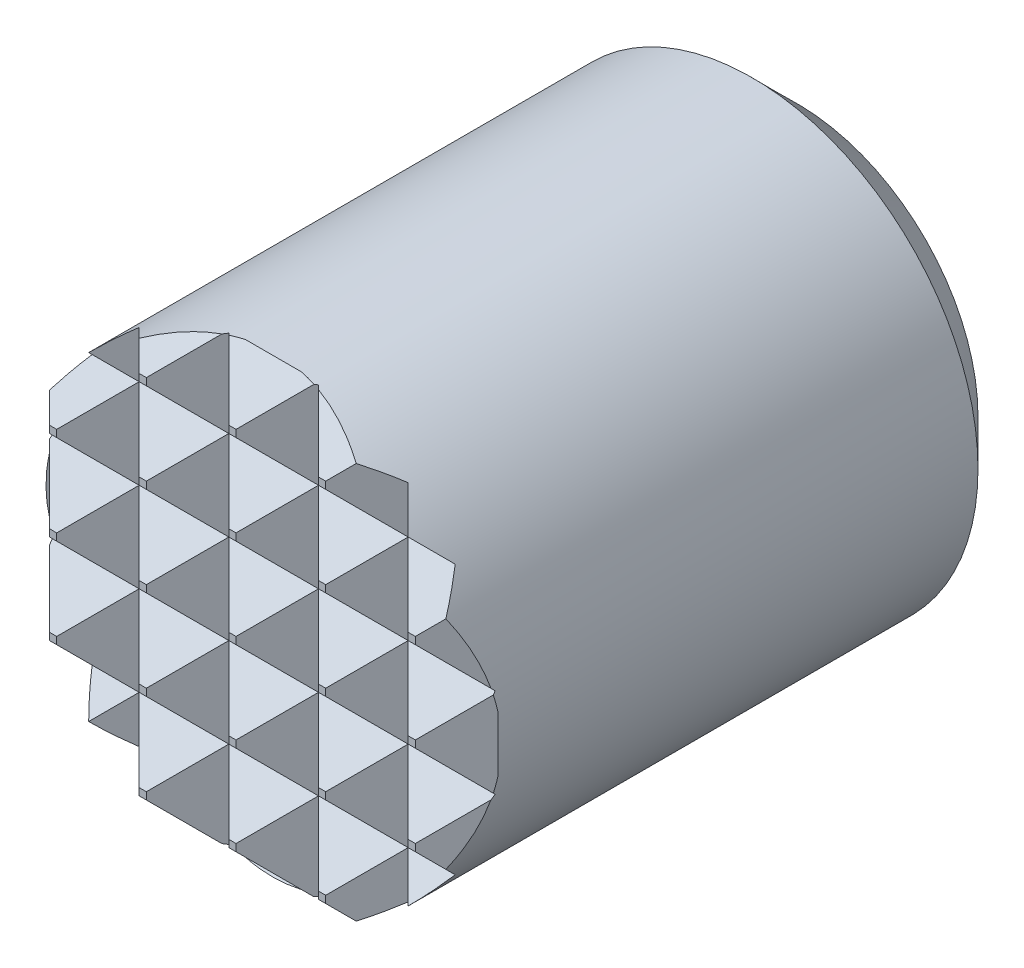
ISO-10303-21;
HEADER;
FILE_DESCRIPTION(('STEP AP214'),'2;1');
FILE_NAME('part.step','',(''),(''),'','','');
FILE_SCHEMA(('AUTOMOTIVE_DESIGN { 1 0 10303 214 1 1 1 1 }'));
ENDSEC;
DATA;
#1=APPLICATION_CONTEXT('core data for automotive mechanical design processes');
#2=APPLICATION_PROTOCOL_DEFINITION('international standard','automotive_design',2000,#1);
#3=PRODUCT_CONTEXT('',#1,'mechanical');
#4=PRODUCT('Part','Part','',(#3));
#5=PRODUCT_RELATED_PRODUCT_CATEGORY('part','',(#4));
#6=PRODUCT_DEFINITION_FORMATION('','',#4);
#7=PRODUCT_DEFINITION_CONTEXT('part definition',#1,'design');
#8=PRODUCT_DEFINITION('design','',#6,#7);
#9=PRODUCT_DEFINITION_SHAPE('','',#8);
#10=(LENGTH_UNIT() NAMED_UNIT(*) SI_UNIT(.MILLI.,.METRE.));
#11=(NAMED_UNIT(*) PLANE_ANGLE_UNIT() SI_UNIT($,.RADIAN.));
#12=(NAMED_UNIT(*) SI_UNIT($,.STERADIAN.) SOLID_ANGLE_UNIT());
#13=UNCERTAINTY_MEASURE_WITH_UNIT(LENGTH_MEASURE(1.E-05),#10,'distance_accuracy_value','');
#14=(GEOMETRIC_REPRESENTATION_CONTEXT(3) GLOBAL_UNCERTAINTY_ASSIGNED_CONTEXT((#13)) GLOBAL_UNIT_ASSIGNED_CONTEXT((#10,
#11,#12)) REPRESENTATION_CONTEXT('',''));
#15=CARTESIAN_POINT('',(0.,0.,0.));
#16=DIRECTION('',(0.,0.,1.));
#17=DIRECTION('',(1.,0.,0.));
#18=AXIS2_PLACEMENT_3D('',#15,#16,#17);
#19=CARTESIAN_POINT('',(0.,0.,10.));
#20=DIRECTION('',(0.,0.,1.));
#21=DIRECTION('',(1.,0.,0.));
#22=AXIS2_PLACEMENT_3D('',#19,#20,#21);
#23=PLANE('',#22);
#24=DIRECTION('',(0.,1.,0.));
#25=VECTOR('',#24,1.);
#26=CARTESIAN_POINT('',(-1.65100000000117,0.,10.));
#27=LINE('',#26,#25);
#28=CARTESIAN_POINT('',(-1.65100000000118,-1.65100000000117,10.));
#29=VERTEX_POINT('',#28);
#30=CARTESIAN_POINT('',(-1.65100000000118,-1.52399999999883,10.));
#31=VERTEX_POINT('',#30);
#32=EDGE_CURVE('E998',#29,#31,#27,.T.);
#33=ORIENTED_EDGE('',*,*,#32,.F.);
#34=DIRECTION('',(-1.,0.,0.));
#35=VECTOR('',#34,1.);
#36=CARTESIAN_POINT('',(0.,-1.65100000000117,10.));
#37=LINE('',#36,#35);
#38=CARTESIAN_POINT('',(-1.52399999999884,-1.65100000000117,10.));
#39=VERTEX_POINT('',#38);
#40=EDGE_CURVE('E2220',#39,#29,#37,.T.);
#41=ORIENTED_EDGE('',*,*,#40,.F.);
#42=DIRECTION('',(0.,-1.,0.));
#43=VECTOR('',#42,1.);
#44=CARTESIAN_POINT('',(-1.52399999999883,0.,10.));
#45=LINE('',#44,#43);
#46=CARTESIAN_POINT('',(-1.52399999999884,-1.52399999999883,10.));
#47=VERTEX_POINT('',#46);
#48=EDGE_CURVE('E921',#47,#39,#45,.T.);
#49=ORIENTED_EDGE('',*,*,#48,.F.);
#50=DIRECTION('',(1.,0.,0.));
#51=VECTOR('',#50,1.);
#52=CARTESIAN_POINT('',(0.,-1.52399999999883,10.));
#53=LINE('',#52,#51);
#54=EDGE_CURVE('E567',#31,#47,#53,.T.);
#55=ORIENTED_EDGE('',*,*,#54,.F.);
#56=EDGE_LOOP('',(#33,#41,#49,#55));
#57=FACE_BOUND('',#56,.T.);
#58=ADVANCED_FACE('F15',(#57),#23,.T.);
#59=DIRECTION('',(0.,1.,0.));
#60=VECTOR('',#59,1.);
#61=CARTESIAN_POINT('',(-1.65100000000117,0.,10.));
#62=LINE('',#61,#60);
#63=CARTESIAN_POINT('',(-1.65100000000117,-0.0635000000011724,10.));
#64=VERTEX_POINT('',#63);
#65=CARTESIAN_POINT('',(-1.65100000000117,0.0635000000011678,10.));
#66=VERTEX_POINT('',#65);
#67=EDGE_CURVE('E990',#64,#66,#62,.T.);
#68=ORIENTED_EDGE('',*,*,#67,.F.);
#69=DIRECTION('',(-1.,0.,0.));
#70=VECTOR('',#69,1.);
#71=CARTESIAN_POINT('',(0.,-0.0635000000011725,10.));
#72=LINE('',#71,#70);
#73=CARTESIAN_POINT('',(-1.52399999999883,-0.0635000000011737,10.));
#74=VERTEX_POINT('',#73);
#75=EDGE_CURVE('E2294',#74,#64,#72,.T.);
#76=ORIENTED_EDGE('',*,*,#75,.F.);
#77=DIRECTION('',(0.,-1.,0.));
#78=VECTOR('',#77,1.);
#79=CARTESIAN_POINT('',(-1.52399999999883,0.,10.));
#80=LINE('',#79,#78);
#81=CARTESIAN_POINT('',(-1.52399999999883,0.0635000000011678,10.));
#82=VERTEX_POINT('',#81);
#83=EDGE_CURVE('E913',#82,#74,#80,.T.);
#84=ORIENTED_EDGE('',*,*,#83,.F.);
#85=DIRECTION('',(1.,0.,0.));
#86=VECTOR('',#85,1.);
#87=CARTESIAN_POINT('',(0.,0.0635000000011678,10.));
#88=LINE('',#87,#86);
#89=EDGE_CURVE('E576',#66,#82,#88,.T.);
#90=ORIENTED_EDGE('',*,*,#89,.F.);
#91=EDGE_LOOP('',(#68,#76,#84,#90));
#92=FACE_BOUND('',#91,.T.);
#93=ADVANCED_FACE('F1073',(#92),#23,.T.);
#94=DIRECTION('',(0.,1.,0.));
#95=VECTOR('',#94,1.);
#96=CARTESIAN_POINT('',(-1.65100000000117,0.,10.));
#97=LINE('',#96,#95);
#98=CARTESIAN_POINT('',(-1.65100000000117,1.52399999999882,10.));
#99=VERTEX_POINT('',#98);
#100=CARTESIAN_POINT('',(-1.65100000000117,1.65100000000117,10.));
#101=VERTEX_POINT('',#100);
#102=EDGE_CURVE('E982',#99,#101,#97,.T.);
#103=ORIENTED_EDGE('',*,*,#102,.F.);
#104=DIRECTION('',(-1.,0.,0.));
#105=VECTOR('',#104,1.);
#106=CARTESIAN_POINT('',(0.,1.52399999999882,10.));
#107=LINE('',#106,#105);
#108=CARTESIAN_POINT('',(-1.52399999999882,1.52399999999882,10.));
#109=VERTEX_POINT('',#108);
#110=EDGE_CURVE('E2067',#109,#99,#107,.T.);
#111=ORIENTED_EDGE('',*,*,#110,.F.);
#112=DIRECTION('',(0.,-1.,0.));
#113=VECTOR('',#112,1.);
#114=CARTESIAN_POINT('',(-1.52399999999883,0.,10.));
#115=LINE('',#114,#113);
#116=CARTESIAN_POINT('',(-1.52399999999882,1.65100000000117,10.));
#117=VERTEX_POINT('',#116);
#118=EDGE_CURVE('E905',#117,#109,#115,.T.);
#119=ORIENTED_EDGE('',*,*,#118,.F.);
#120=DIRECTION('',(1.,0.,0.));
#121=VECTOR('',#120,1.);
#122=CARTESIAN_POINT('',(0.,1.65100000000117,10.));
#123=LINE('',#122,#121);
#124=EDGE_CURVE('E585',#101,#117,#123,.T.);
#125=ORIENTED_EDGE('',*,*,#124,.F.);
#126=EDGE_LOOP('',(#103,#111,#119,#125));
#127=FACE_BOUND('',#126,.T.);
#128=ADVANCED_FACE('F1079',(#127),#23,.T.);
#129=CARTESIAN_POINT('',(-4.,2.38125,9.26975000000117));
#130=DIRECTION('',(0.,0.70710678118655,-0.707106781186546));
#131=DIRECTION('',(0.,0.707106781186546,0.70710678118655));
#132=AXIS2_PLACEMENT_3D('',#129,#130,#131);
#133=PLANE('',#132);
#134=DIRECTION('',(-1.,0.,0.));
#135=VECTOR('',#134,1.);
#136=CARTESIAN_POINT('',(0.,3.11149999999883,10.));
#137=LINE('',#136,#135);
#138=CARTESIAN_POINT('',(-1.52399999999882,3.11149999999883,10.));
#139=VERTEX_POINT('',#138);
#140=CARTESIAN_POINT('',(-1.65100000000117,3.11149999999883,10.));
#141=VERTEX_POINT('',#140);
#142=EDGE_CURVE('E582',#139,#141,#137,.T.);
#143=ORIENTED_EDGE('',*,*,#142,.T.);
#144=DIRECTION('',(-0.577350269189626,-0.577350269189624,-0.577350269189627));
#145=VECTOR('',#144,1.);
#146=CARTESIAN_POINT('',(-2.92083333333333,1.84166666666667,8.73016666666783));
#147=LINE('',#146,#145);
#148=CARTESIAN_POINT('',(-2.38125,2.38125,9.26975000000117));
#149=VERTEX_POINT('',#148);
#150=EDGE_CURVE('E976',#141,#149,#147,.T.);
#151=ORIENTED_EDGE('',*,*,#150,.T.);
#152=DIRECTION('',(1.,0.,0.));
#153=VECTOR('',#152,1.);
#154=CARTESIAN_POINT('',(-4.,2.38125,9.26975000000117));
#155=LINE('',#154,#153);
#156=CARTESIAN_POINT('',(-0.793749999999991,2.38125,9.26975000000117));
#157=VERTEX_POINT('',#156);
#158=EDGE_CURVE('E611',#149,#157,#155,.T.);
#159=ORIENTED_EDGE('',*,*,#158,.T.);
#160=DIRECTION('',(-0.577350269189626,0.577350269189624,0.577350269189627));
#161=VECTOR('',#160,1.);
#162=CARTESIAN_POINT('',(-1.8625,3.45,10.3385000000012));
#163=LINE('',#162,#161);
#164=EDGE_CURVE('E899',#157,#139,#163,.T.);
#165=ORIENTED_EDGE('',*,*,#164,.T.);
#166=EDGE_LOOP('',(#143,#151,#159,#165));
#167=FACE_BOUND('',#166,.T.);
#168=ADVANCED_FACE('F1097',(#167),#133,.F.);
#169=CARTESIAN_POINT('',(-4.,1.5875,10.0635000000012));
#170=DIRECTION('',(0.,-0.707106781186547,-0.707106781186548));
#171=DIRECTION('',(0.,0.707106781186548,-0.707106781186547));
#172=AXIS2_PLACEMENT_3D('',#169,#170,#171);
#173=PLANE('',#172);
#174=ORIENTED_EDGE('',*,*,#158,.F.);
#175=DIRECTION('',(0.577350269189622,-0.577350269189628,0.577350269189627));
#176=VECTOR('',#175,1.);
#177=CARTESIAN_POINT('',(-2.39166666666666,2.39166666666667,9.25933333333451));
#178=LINE('',#177,#176);
#179=EDGE_CURVE('E979',#149,#101,#178,.T.);
#180=ORIENTED_EDGE('',*,*,#179,.T.);
#181=ORIENTED_EDGE('',*,*,#124,.T.);
#182=DIRECTION('',(0.577350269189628,0.577350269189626,-0.577350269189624));
#183=VECTOR('',#182,1.);
#184=CARTESIAN_POINT('',(-2.39166666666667,0.783333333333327,10.8676666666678));
#185=LINE('',#184,#183);
#186=EDGE_CURVE('E902',#117,#157,#185,.T.);
#187=ORIENTED_EDGE('',*,*,#186,.T.);
#188=EDGE_LOOP('',(#174,#180,#181,#187));
#189=FACE_BOUND('',#188,.T.);
#190=ADVANCED_FACE('F1103',(#189),#173,.F.);
#191=CARTESIAN_POINT('',(-4.,0.79375,9.26975000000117));
#192=DIRECTION('',(0.,0.70710678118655,-0.707106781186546));
#193=DIRECTION('',(0.,0.707106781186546,0.70710678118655));
#194=AXIS2_PLACEMENT_3D('',#191,#192,#193);
#195=PLANE('',#194);
#196=ORIENTED_EDGE('',*,*,#110,.T.);
#197=DIRECTION('',(-0.577350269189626,-0.577350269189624,-0.577350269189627));
#198=VECTOR('',#197,1.);
#199=CARTESIAN_POINT('',(-2.92083333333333,0.254166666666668,8.73016666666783));
#200=LINE('',#199,#198);
#201=CARTESIAN_POINT('',(-2.38125,0.79375,9.26975000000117));
#202=VERTEX_POINT('',#201);
#203=EDGE_CURVE('E984',#99,#202,#200,.T.);
#204=ORIENTED_EDGE('',*,*,#203,.T.);
#205=DIRECTION('',(1.,0.,0.));
#206=VECTOR('',#205,1.);
#207=CARTESIAN_POINT('',(-4.,0.79375,9.26975000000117));
#208=LINE('',#207,#206);
#209=CARTESIAN_POINT('',(-0.79375,0.79375,9.26975000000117));
#210=VERTEX_POINT('',#209);
#211=EDGE_CURVE('E623',#202,#210,#208,.T.);
#212=ORIENTED_EDGE('',*,*,#211,.T.);
#213=DIRECTION('',(-0.577350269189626,0.577350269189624,0.577350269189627));
#214=VECTOR('',#213,1.);
#215=CARTESIAN_POINT('',(-1.8625,1.8625,10.3385000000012));
#216=LINE('',#215,#214);
#217=EDGE_CURVE('E907',#210,#109,#216,.T.);
#218=ORIENTED_EDGE('',*,*,#217,.T.);
#219=EDGE_LOOP('',(#196,#204,#212,#218));
#220=FACE_BOUND('',#219,.T.);
#221=ADVANCED_FACE('F1115',(#220),#195,.F.);
#222=CARTESIAN_POINT('',(-4.,0.,10.0635000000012));
#223=DIRECTION('',(0.,-0.707106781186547,-0.707106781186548));
#224=DIRECTION('',(0.,0.707106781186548,-0.707106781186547));
#225=AXIS2_PLACEMENT_3D('',#222,#223,#224);
#226=PLANE('',#225);
#227=ORIENTED_EDGE('',*,*,#211,.F.);
#228=DIRECTION('',(0.577350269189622,-0.577350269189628,0.577350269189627));
#229=VECTOR('',#228,1.);
#230=CARTESIAN_POINT('',(-2.39166666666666,0.804166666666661,9.25933333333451));
#231=LINE('',#230,#229);
#232=EDGE_CURVE('E987',#202,#66,#231,.T.);
#233=ORIENTED_EDGE('',*,*,#232,.T.);
#234=ORIENTED_EDGE('',*,*,#89,.T.);
#235=DIRECTION('',(0.577350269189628,0.577350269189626,-0.577350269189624));
#236=VECTOR('',#235,1.);
#237=CARTESIAN_POINT('',(-2.39166666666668,-0.804166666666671,10.8676666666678));
#238=LINE('',#237,#236);
#239=EDGE_CURVE('E910',#82,#210,#238,.T.);
#240=ORIENTED_EDGE('',*,*,#239,.T.);
#241=EDGE_LOOP('',(#227,#233,#234,#240));
#242=FACE_BOUND('',#241,.T.);
#243=ADVANCED_FACE('F1110',(#242),#226,.F.);
#244=CARTESIAN_POINT('',(-4.,-0.79375,9.26975000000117));
#245=DIRECTION('',(0.,0.70710678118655,-0.707106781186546));
#246=DIRECTION('',(0.,0.707106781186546,0.70710678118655));
#247=AXIS2_PLACEMENT_3D('',#244,#245,#246);
#248=PLANE('',#247);
#249=ORIENTED_EDGE('',*,*,#75,.T.);
#250=DIRECTION('',(-0.577350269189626,-0.577350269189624,-0.577350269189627));
#251=VECTOR('',#250,1.);
#252=CARTESIAN_POINT('',(-2.92083333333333,-1.33333333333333,8.73016666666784));
#253=LINE('',#252,#251);
#254=CARTESIAN_POINT('',(-2.38125,-0.79375,9.26975000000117));
#255=VERTEX_POINT('',#254);
#256=EDGE_CURVE('E992',#64,#255,#253,.T.);
#257=ORIENTED_EDGE('',*,*,#256,.T.);
#258=DIRECTION('',(1.,0.,0.));
#259=VECTOR('',#258,1.);
#260=CARTESIAN_POINT('',(-4.,-0.79375,9.26975000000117));
#261=LINE('',#260,#259);
#262=CARTESIAN_POINT('',(-0.79375,-0.79375,9.26975000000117));
#263=VERTEX_POINT('',#262);
#264=EDGE_CURVE('E635',#255,#263,#261,.T.);
#265=ORIENTED_EDGE('',*,*,#264,.T.);
#266=DIRECTION('',(-0.577350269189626,0.577350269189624,0.577350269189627));
#267=VECTOR('',#266,1.);
#268=CARTESIAN_POINT('',(-1.8625,0.275,10.3385000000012));
#269=LINE('',#268,#267);
#270=EDGE_CURVE('E915',#263,#74,#269,.T.);
#271=ORIENTED_EDGE('',*,*,#270,.T.);
#272=EDGE_LOOP('',(#249,#257,#265,#271));
#273=FACE_BOUND('',#272,.T.);
#274=ADVANCED_FACE('F1121',(#273),#248,.F.);
#275=CARTESIAN_POINT('',(-4.,-1.5875,10.0635000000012));
#276=DIRECTION('',(0.,-0.707106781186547,-0.707106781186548));
#277=DIRECTION('',(0.,0.707106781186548,-0.707106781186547));
#278=AXIS2_PLACEMENT_3D('',#275,#276,#277);
#279=PLANE('',#278);
#280=ORIENTED_EDGE('',*,*,#264,.F.);
#281=DIRECTION('',(0.577350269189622,-0.577350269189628,0.577350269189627));
#282=VECTOR('',#281,1.);
#283=CARTESIAN_POINT('',(-2.39166666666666,-0.78333333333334,9.25933333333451));
#284=LINE('',#283,#282);
#285=EDGE_CURVE('E995',#255,#31,#284,.T.);
#286=ORIENTED_EDGE('',*,*,#285,.T.);
#287=ORIENTED_EDGE('',*,*,#54,.T.);
#288=DIRECTION('',(0.577350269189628,0.577350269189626,-0.577350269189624));
#289=VECTOR('',#288,1.);
#290=CARTESIAN_POINT('',(-2.39166666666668,-2.39166666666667,10.8676666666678));
#291=LINE('',#290,#289);
#292=EDGE_CURVE('E918',#47,#263,#291,.T.);
#293=ORIENTED_EDGE('',*,*,#292,.T.);
#294=EDGE_LOOP('',(#280,#286,#287,#293));
#295=FACE_BOUND('',#294,.T.);
#296=ADVANCED_FACE('F1127',(#295),#279,.F.);
#297=CARTESIAN_POINT('',(-4.,-2.38125,9.26975000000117));
#298=DIRECTION('',(0.,0.70710678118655,-0.707106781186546));
#299=DIRECTION('',(0.,0.707106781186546,0.70710678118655));
#300=AXIS2_PLACEMENT_3D('',#297,#298,#299);
#301=PLANE('',#300);
#302=ORIENTED_EDGE('',*,*,#40,.T.);
#303=DIRECTION('',(-0.577350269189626,-0.577350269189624,-0.577350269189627));
#304=VECTOR('',#303,1.);
#305=CARTESIAN_POINT('',(-2.92083333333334,-2.92083333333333,8.73016666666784));
#306=LINE('',#305,#304);
#307=CARTESIAN_POINT('',(-2.38125,-2.38125,9.26975000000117));
#308=VERTEX_POINT('',#307);
#309=EDGE_CURVE('E1000',#29,#308,#306,.T.);
#310=ORIENTED_EDGE('',*,*,#309,.T.);
#311=DIRECTION('',(1.,0.,0.));
#312=VECTOR('',#311,1.);
#313=CARTESIAN_POINT('',(-4.,-2.38125,9.26975000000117));
#314=LINE('',#313,#312);
#315=CARTESIAN_POINT('',(-0.79375,-2.38125,9.26975000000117));
#316=VERTEX_POINT('',#315);
#317=EDGE_CURVE('E647',#308,#316,#314,.T.);
#318=ORIENTED_EDGE('',*,*,#317,.T.);
#319=DIRECTION('',(-0.577350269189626,0.577350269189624,0.577350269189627));
#320=VECTOR('',#319,1.);
#321=CARTESIAN_POINT('',(-1.8625,-1.3125,10.3385000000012));
#322=LINE('',#321,#320);
#323=EDGE_CURVE('E923',#316,#39,#322,.T.);
#324=ORIENTED_EDGE('',*,*,#323,.T.);
#325=EDGE_LOOP('',(#302,#310,#318,#324));
#326=FACE_BOUND('',#325,.T.);
#327=ADVANCED_FACE('F1133',(#326),#301,.F.);
#328=CARTESIAN_POINT('',(-4.,-3.175,10.0635000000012));
#329=DIRECTION('',(0.,-0.707106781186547,-0.707106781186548));
#330=DIRECTION('',(0.,0.707106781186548,-0.707106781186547));
#331=AXIS2_PLACEMENT_3D('',#328,#329,#330);
#332=PLANE('',#331);
#333=ORIENTED_EDGE('',*,*,#317,.F.);
#334=DIRECTION('',(0.577350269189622,-0.577350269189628,0.577350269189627));
#335=VECTOR('',#334,1.);
#336=CARTESIAN_POINT('',(-2.39166666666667,-2.37083333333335,9.25933333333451));
#337=LINE('',#336,#335);
#338=CARTESIAN_POINT('',(-1.65100000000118,-3.11149999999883,10.));
#339=VERTEX_POINT('',#338);
#340=EDGE_CURVE('E1003',#308,#339,#337,.T.);
#341=ORIENTED_EDGE('',*,*,#340,.T.);
#342=DIRECTION('',(1.,0.,0.));
#343=VECTOR('',#342,1.);
#344=CARTESIAN_POINT('',(0.,-3.11149999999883,10.));
#345=LINE('',#344,#343);
#346=CARTESIAN_POINT('',(-1.52399999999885,-3.11149999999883,10.));
#347=VERTEX_POINT('',#346);
#348=EDGE_CURVE('E556',#339,#347,#345,.T.);
#349=ORIENTED_EDGE('',*,*,#348,.T.);
#350=DIRECTION('',(0.577350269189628,0.577350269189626,-0.577350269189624));
#351=VECTOR('',#350,1.);
#352=CARTESIAN_POINT('',(-2.39166666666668,-3.97916666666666,10.8676666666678));
#353=LINE('',#352,#351);
#354=EDGE_CURVE('E926',#347,#316,#353,.T.);
#355=ORIENTED_EDGE('',*,*,#354,.T.);
#356=EDGE_LOOP('',(#333,#341,#349,#355));
#357=FACE_BOUND('',#356,.T.);
#358=ADVANCED_FACE('F1139',(#357),#332,.F.);
#359=DIRECTION('',(0.,1.,0.));
#360=VECTOR('',#359,1.);
#361=CARTESIAN_POINT('',(-0.0635000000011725,0.,10.));
#362=LINE('',#361,#360);
#363=CARTESIAN_POINT('',(-0.0635000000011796,-1.65100000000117,10.));
#364=VERTEX_POINT('',#363);
#365=CARTESIAN_POINT('',(-0.0635000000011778,-1.52399999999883,10.));
#366=VERTEX_POINT('',#365);
#367=EDGE_CURVE('E880',#364,#366,#362,.T.);
#368=ORIENTED_EDGE('',*,*,#367,.F.);
#369=CARTESIAN_POINT('',(0.0635000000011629,-1.65100000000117,10.));
#370=VERTEX_POINT('',#369);
#371=EDGE_CURVE('E2168',#370,#364,#37,.T.);
#372=ORIENTED_EDGE('',*,*,#371,.F.);
#373=DIRECTION('',(0.,-1.,0.));
#374=VECTOR('',#373,1.);
#375=CARTESIAN_POINT('',(0.0635000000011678,0.,10.));
#376=LINE('',#375,#374);
#377=CARTESIAN_POINT('',(0.0635000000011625,-1.52399999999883,10.));
#378=VERTEX_POINT('',#377);
#379=EDGE_CURVE('E834',#378,#370,#376,.T.);
#380=ORIENTED_EDGE('',*,*,#379,.F.);
#381=EDGE_CURVE('E2203',#366,#378,#53,.T.);
#382=ORIENTED_EDGE('',*,*,#381,.F.);
#383=EDGE_LOOP('',(#368,#372,#380,#382));
#384=FACE_BOUND('',#383,.T.);
#385=ADVANCED_FACE('F1797',(#384),#23,.T.);
#386=DIRECTION('',(0.,1.,0.));
#387=VECTOR('',#386,1.);
#388=CARTESIAN_POINT('',(-0.0635000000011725,0.,10.));
#389=LINE('',#388,#387);
#390=CARTESIAN_POINT('',(-0.0635000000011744,-0.0635000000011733,10.));
#391=VERTEX_POINT('',#390);
#392=CARTESIAN_POINT('',(-0.0635000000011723,0.0635000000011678,10.));
#393=VERTEX_POINT('',#392);
#394=EDGE_CURVE('E872',#391,#393,#389,.T.);
#395=ORIENTED_EDGE('',*,*,#394,.F.);
#396=CARTESIAN_POINT('',(0.0635000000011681,-0.0635000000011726,10.));
#397=VERTEX_POINT('',#396);
#398=EDGE_CURVE('E2300',#397,#391,#72,.T.);
#399=ORIENTED_EDGE('',*,*,#398,.F.);
#400=DIRECTION('',(0.,-1.,0.));
#401=VECTOR('',#400,1.);
#402=CARTESIAN_POINT('',(0.0635000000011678,0.,10.));
#403=LINE('',#402,#401);
#404=CARTESIAN_POINT('',(0.063500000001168,0.0635000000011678,10.));
#405=VERTEX_POINT('',#404);
#406=EDGE_CURVE('E826',#405,#397,#403,.T.);
#407=ORIENTED_EDGE('',*,*,#406,.F.);
#408=EDGE_CURVE('E2259',#393,#405,#88,.T.);
#409=ORIENTED_EDGE('',*,*,#408,.F.);
#410=EDGE_LOOP('',(#395,#399,#407,#409));
#411=FACE_BOUND('',#410,.T.);
#412=ADVANCED_FACE('F1786',(#411),#23,.T.);
#413=DIRECTION('',(0.,1.,0.));
#414=VECTOR('',#413,1.);
#415=CARTESIAN_POINT('',(-0.0635000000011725,0.,10.));
#416=LINE('',#415,#414);
#417=CARTESIAN_POINT('',(-0.0635000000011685,1.52399999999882,10.));
#418=VERTEX_POINT('',#417);
#419=CARTESIAN_POINT('',(-0.0635000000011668,1.65100000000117,10.));
#420=VERTEX_POINT('',#419);
#421=EDGE_CURVE('E864',#418,#420,#416,.T.);
#422=ORIENTED_EDGE('',*,*,#421,.F.);
#423=CARTESIAN_POINT('',(0.0635000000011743,1.52399999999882,10.));
#424=VERTEX_POINT('',#423);
#425=EDGE_CURVE('E2426',#424,#418,#107,.T.);
#426=ORIENTED_EDGE('',*,*,#425,.F.);
#427=DIRECTION('',(0.,-1.,0.));
#428=VECTOR('',#427,1.);
#429=CARTESIAN_POINT('',(0.0635000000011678,0.,10.));
#430=LINE('',#429,#428);
#431=CARTESIAN_POINT('',(0.0635000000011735,1.65100000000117,10.));
#432=VERTEX_POINT('',#431);
#433=EDGE_CURVE('E818',#432,#424,#430,.T.);
#434=ORIENTED_EDGE('',*,*,#433,.F.);
#435=EDGE_CURVE('E2107',#420,#432,#123,.T.);
#436=ORIENTED_EDGE('',*,*,#435,.F.);
#437=EDGE_LOOP('',(#422,#426,#434,#436));
#438=FACE_BOUND('',#437,.T.);
#439=ADVANCED_FACE('F1780',(#438),#23,.T.);
#440=DIRECTION('',(0.,1.,0.));
#441=VECTOR('',#440,1.);
#442=CARTESIAN_POINT('',(-0.0635000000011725,0.,10.));
#443=LINE('',#442,#441);
#444=CARTESIAN_POINT('',(-0.0635000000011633,3.11149999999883,10.));
#445=VERTEX_POINT('',#444);
#446=CARTESIAN_POINT('',(-0.0635000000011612,3.23850000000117,10.));
#447=VERTEX_POINT('',#446);
#448=EDGE_CURVE('E856',#445,#447,#443,.T.);
#449=ORIENTED_EDGE('',*,*,#448,.F.);
#450=CARTESIAN_POINT('',(0.0635000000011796,3.11149999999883,10.));
#451=VERTEX_POINT('',#450);
#452=EDGE_CURVE('E581',#451,#445,#137,.T.);
#453=ORIENTED_EDGE('',*,*,#452,.F.);
#454=DIRECTION('',(0.,-1.,0.));
#455=VECTOR('',#454,1.);
#456=CARTESIAN_POINT('',(0.0635000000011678,0.,10.));
#457=LINE('',#456,#455);
#458=CARTESIAN_POINT('',(0.0635000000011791,3.23850000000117,10.));
#459=VERTEX_POINT('',#458);
#460=EDGE_CURVE('E810',#459,#451,#457,.T.);
#461=ORIENTED_EDGE('',*,*,#460,.F.);
#462=DIRECTION('',(1.,0.,0.));
#463=VECTOR('',#462,1.);
#464=CARTESIAN_POINT('',(0.,3.23850000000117,10.));
#465=LINE('',#464,#463);
#466=EDGE_CURVE('E592',#447,#459,#465,.T.);
#467=ORIENTED_EDGE('',*,*,#466,.F.);
#468=EDGE_LOOP('',(#449,#453,#461,#467));
#469=FACE_BOUND('',#468,.T.);
#470=ADVANCED_FACE('F1785',(#469),#23,.T.);
#471=DIRECTION('',(0.,1.,0.));
#472=VECTOR('',#471,1.);
#473=CARTESIAN_POINT('',(-0.0635000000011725,0.,10.));
#474=LINE('',#473,#472);
#475=CARTESIAN_POINT('',(-0.0635000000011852,-3.23850000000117,10.));
#476=VERTEX_POINT('',#475);
#477=CARTESIAN_POINT('',(-0.0635000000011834,-3.11149999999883,10.));
#478=VERTEX_POINT('',#477);
#479=EDGE_CURVE('E891',#476,#478,#474,.T.);
#480=ORIENTED_EDGE('',*,*,#479,.F.);
#481=DIRECTION('',(-1.,0.,0.));
#482=VECTOR('',#481,1.);
#483=CARTESIAN_POINT('',(0.,-3.23850000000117,10.));
#484=LINE('',#483,#482);
#485=CARTESIAN_POINT('',(0.0635000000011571,-3.23850000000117,10.));
#486=VERTEX_POINT('',#485);
#487=EDGE_CURVE('E549',#486,#476,#484,.T.);
#488=ORIENTED_EDGE('',*,*,#487,.F.);
#489=DIRECTION('',(0.,-1.,0.));
#490=VECTOR('',#489,1.);
#491=CARTESIAN_POINT('',(0.0635000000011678,0.,10.));
#492=LINE('',#491,#490);
#493=CARTESIAN_POINT('',(0.0635000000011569,-3.11149999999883,10.));
#494=VERTEX_POINT('',#493);
#495=EDGE_CURVE('E845',#494,#486,#492,.T.);
#496=ORIENTED_EDGE('',*,*,#495,.F.);
#497=EDGE_CURVE('E558',#478,#494,#345,.T.);
#498=ORIENTED_EDGE('',*,*,#497,.F.);
#499=EDGE_LOOP('',(#480,#488,#496,#498));
#500=FACE_BOUND('',#499,.T.);
#501=ADVANCED_FACE('F1871',(#500),#23,.T.);
#502=CARTESIAN_POINT('',(-4.,3.175,10.0635000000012));
#503=DIRECTION('',(0.,-0.707106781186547,-0.707106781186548));
#504=DIRECTION('',(0.,0.707106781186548,-0.707106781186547));
#505=AXIS2_PLACEMENT_3D('',#502,#503,#504);
#506=PLANE('',#505);
#507=CARTESIAN_POINT('',(0.,0.,13.2385000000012));
#508=DIRECTION('',(0.,-0.707106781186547,-0.707106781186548));
#509=DIRECTION('',(0.,0.707106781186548,-0.707106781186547));
#510=AXIS2_PLACEMENT_3D('',#507,#508,#509);
#511=ELLIPSE('',#510,5.65685424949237,4.);
#512=CARTESIAN_POINT('',(-0.753406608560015,3.92840660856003,9.31009339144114));
#513=VERTEX_POINT('',#512);
#514=CARTESIAN_POINT('',(-0.499022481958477,3.96875,9.26975000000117));
#515=VERTEX_POINT('',#514);
#516=EDGE_CURVE('E597',#513,#515,#511,.T.);
#517=ORIENTED_EDGE('',*,*,#516,.F.);
#518=DIRECTION('',(0.577350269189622,-0.577350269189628,0.577350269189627));
#519=VECTOR('',#518,1.);
#520=CARTESIAN_POINT('',(-1.33333333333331,4.50833333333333,8.73016666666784));
#521=LINE('',#520,#519);
#522=EDGE_CURVE('E853',#513,#447,#521,.T.);
#523=ORIENTED_EDGE('',*,*,#522,.T.);
#524=ORIENTED_EDGE('',*,*,#466,.T.);
#525=DIRECTION('',(0.577350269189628,0.577350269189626,-0.577350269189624));
#526=VECTOR('',#525,1.);
#527=CARTESIAN_POINT('',(-1.33333333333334,1.84166666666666,11.3968333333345));
#528=LINE('',#527,#526);
#529=CARTESIAN_POINT('',(0.753406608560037,3.92840660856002,9.31009339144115));
#530=VERTEX_POINT('',#529);
#531=EDGE_CURVE('E807',#459,#530,#528,.T.);
#532=ORIENTED_EDGE('',*,*,#531,.T.);
#533=CARTESIAN_POINT('',(0.499022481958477,3.96875,9.26975000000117));
#534=VERTEX_POINT('',#533);
#535=EDGE_CURVE('E598',#534,#530,#511,.T.);
#536=ORIENTED_EDGE('',*,*,#535,.F.);
#537=DIRECTION('',(1.,0.,0.));
#538=VECTOR('',#537,1.);
#539=CARTESIAN_POINT('',(-4.,3.96875,9.26975000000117));
#540=LINE('',#539,#538);
#541=EDGE_CURVE('E599',#515,#534,#540,.T.);
#542=ORIENTED_EDGE('',*,*,#541,.F.);
#543=EDGE_LOOP('',(#517,#523,#524,#532,#536,#542));
#544=FACE_BOUND('',#543,.T.);
#545=ADVANCED_FACE('F1091',(#544),#506,.F.);
#546=ORIENTED_EDGE('',*,*,#452,.T.);
#547=DIRECTION('',(-0.577350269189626,-0.577350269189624,-0.577350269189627));
#548=VECTOR('',#547,1.);
#549=CARTESIAN_POINT('',(-1.8625,1.3125,8.20100000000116));
#550=LINE('',#549,#548);
#551=EDGE_CURVE('E858',#445,#157,#550,.T.);
#552=ORIENTED_EDGE('',*,*,#551,.T.);
#553=CARTESIAN_POINT('',(0.793750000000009,2.38125,9.26975000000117));
#554=VERTEX_POINT('',#553);
#555=EDGE_CURVE('E2077',#157,#554,#155,.T.);
#556=ORIENTED_EDGE('',*,*,#555,.T.);
#557=DIRECTION('',(-0.577350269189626,0.577350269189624,0.577350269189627));
#558=VECTOR('',#557,1.);
#559=CARTESIAN_POINT('',(-0.804166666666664,3.97916666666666,10.8676666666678));
#560=LINE('',#559,#558);
#561=EDGE_CURVE('E812',#554,#451,#560,.T.);
#562=ORIENTED_EDGE('',*,*,#561,.T.);
#563=EDGE_LOOP('',(#546,#552,#556,#562));
#564=FACE_BOUND('',#563,.T.);
#565=ADVANCED_FACE('F1773',(#564),#133,.F.);
#566=ORIENTED_EDGE('',*,*,#555,.F.);
#567=DIRECTION('',(0.577350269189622,-0.577350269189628,0.577350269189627));
#568=VECTOR('',#567,1.);
#569=CARTESIAN_POINT('',(-1.33333333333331,2.92083333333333,8.73016666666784));
#570=LINE('',#569,#568);
#571=EDGE_CURVE('E861',#157,#420,#570,.T.);
#572=ORIENTED_EDGE('',*,*,#571,.T.);
#573=ORIENTED_EDGE('',*,*,#435,.T.);
#574=DIRECTION('',(0.577350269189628,0.577350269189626,-0.577350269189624));
#575=VECTOR('',#574,1.);
#576=CARTESIAN_POINT('',(-1.33333333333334,0.254166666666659,11.3968333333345));
#577=LINE('',#576,#575);
#578=EDGE_CURVE('E815',#432,#554,#577,.T.);
#579=ORIENTED_EDGE('',*,*,#578,.T.);
#580=EDGE_LOOP('',(#566,#572,#573,#579));
#581=FACE_BOUND('',#580,.T.);
#582=ADVANCED_FACE('F1721',(#581),#173,.F.);
#583=ORIENTED_EDGE('',*,*,#425,.T.);
#584=DIRECTION('',(-0.577350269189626,-0.577350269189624,-0.577350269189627));
#585=VECTOR('',#584,1.);
#586=CARTESIAN_POINT('',(-1.8625,-0.275,8.20100000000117));
#587=LINE('',#586,#585);
#588=EDGE_CURVE('E866',#418,#210,#587,.T.);
#589=ORIENTED_EDGE('',*,*,#588,.T.);
#590=CARTESIAN_POINT('',(0.79375,0.79375,9.26975000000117));
#591=VERTEX_POINT('',#590);
#592=EDGE_CURVE('E2064',#210,#591,#208,.T.);
#593=ORIENTED_EDGE('',*,*,#592,.T.);
#594=DIRECTION('',(-0.577350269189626,0.577350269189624,0.577350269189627));
#595=VECTOR('',#594,1.);
#596=CARTESIAN_POINT('',(-0.804166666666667,2.39166666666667,10.8676666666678));
#597=LINE('',#596,#595);
#598=EDGE_CURVE('E820',#591,#424,#597,.T.);
#599=ORIENTED_EDGE('',*,*,#598,.T.);
#600=EDGE_LOOP('',(#583,#589,#593,#599));
#601=FACE_BOUND('',#600,.T.);
#602=ADVANCED_FACE('F1711',(#601),#195,.F.);
#603=ORIENTED_EDGE('',*,*,#592,.F.);
#604=DIRECTION('',(0.577350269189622,-0.577350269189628,0.577350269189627));
#605=VECTOR('',#604,1.);
#606=CARTESIAN_POINT('',(-1.33333333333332,1.33333333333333,8.73016666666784));
#607=LINE('',#606,#605);
#608=EDGE_CURVE('E869',#210,#393,#607,.T.);
#609=ORIENTED_EDGE('',*,*,#608,.T.);
#610=ORIENTED_EDGE('',*,*,#408,.T.);
#611=DIRECTION('',(0.577350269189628,0.577350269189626,-0.577350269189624));
#612=VECTOR('',#611,1.);
#613=CARTESIAN_POINT('',(-1.33333333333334,-1.33333333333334,11.3968333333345));
#614=LINE('',#613,#612);
#615=EDGE_CURVE('E823',#405,#591,#614,.T.);
#616=ORIENTED_EDGE('',*,*,#615,.T.);
#617=EDGE_LOOP('',(#603,#609,#610,#616));
#618=FACE_BOUND('',#617,.T.);
#619=ADVANCED_FACE('F1699',(#618),#226,.F.);
#620=ORIENTED_EDGE('',*,*,#398,.T.);
#621=DIRECTION('',(-0.577350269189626,-0.577350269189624,-0.577350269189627));
#622=VECTOR('',#621,1.);
#623=CARTESIAN_POINT('',(-1.8625,-1.8625,8.20100000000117));
#624=LINE('',#623,#622);
#625=EDGE_CURVE('E874',#391,#263,#624,.T.);
#626=ORIENTED_EDGE('',*,*,#625,.T.);
#627=CARTESIAN_POINT('',(0.79375,-0.79375,9.26975000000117));
#628=VERTEX_POINT('',#627);
#629=EDGE_CURVE('E2133',#263,#628,#261,.T.);
#630=ORIENTED_EDGE('',*,*,#629,.T.);
#631=DIRECTION('',(-0.577350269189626,0.577350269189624,0.577350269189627));
#632=VECTOR('',#631,1.);
#633=CARTESIAN_POINT('',(-0.804166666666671,0.804166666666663,10.8676666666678));
#634=LINE('',#633,#632);
#635=EDGE_CURVE('E828',#628,#397,#634,.T.);
#636=ORIENTED_EDGE('',*,*,#635,.T.);
#637=EDGE_LOOP('',(#620,#626,#630,#636));
#638=FACE_BOUND('',#637,.T.);
#639=ADVANCED_FACE('F1754',(#638),#248,.F.);
#640=ORIENTED_EDGE('',*,*,#629,.F.);
#641=DIRECTION('',(0.577350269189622,-0.577350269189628,0.577350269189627));
#642=VECTOR('',#641,1.);
#643=CARTESIAN_POINT('',(-1.33333333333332,-0.254166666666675,8.73016666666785));
#644=LINE('',#643,#642);
#645=EDGE_CURVE('E877',#263,#366,#644,.T.);
#646=ORIENTED_EDGE('',*,*,#645,.T.);
#647=ORIENTED_EDGE('',*,*,#381,.T.);
#648=DIRECTION('',(0.577350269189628,0.577350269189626,-0.577350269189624));
#649=VECTOR('',#648,1.);
#650=CARTESIAN_POINT('',(-1.33333333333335,-2.92083333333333,11.3968333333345));
#651=LINE('',#650,#649);
#652=EDGE_CURVE('E831',#378,#628,#651,.T.);
#653=ORIENTED_EDGE('',*,*,#652,.T.);
#654=EDGE_LOOP('',(#640,#646,#647,#653));
#655=FACE_BOUND('',#654,.T.);
#656=ADVANCED_FACE('F2284',(#655),#279,.F.);
#657=ORIENTED_EDGE('',*,*,#371,.T.);
#658=DIRECTION('',(-0.577350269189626,-0.577350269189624,-0.577350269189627));
#659=VECTOR('',#658,1.);
#660=CARTESIAN_POINT('',(-1.8625,-3.45,8.20100000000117));
#661=LINE('',#660,#659);
#662=EDGE_CURVE('E882',#364,#316,#661,.T.);
#663=ORIENTED_EDGE('',*,*,#662,.T.);
#664=CARTESIAN_POINT('',(0.79375,-2.38125,9.26975000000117));
#665=VERTEX_POINT('',#664);
#666=EDGE_CURVE('E2161',#316,#665,#314,.T.);
#667=ORIENTED_EDGE('',*,*,#666,.T.);
#668=DIRECTION('',(-0.577350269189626,0.577350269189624,0.577350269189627));
#669=VECTOR('',#668,1.);
#670=CARTESIAN_POINT('',(-0.804166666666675,-0.783333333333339,10.8676666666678));
#671=LINE('',#670,#669);
#672=EDGE_CURVE('E836',#665,#370,#671,.T.);
#673=ORIENTED_EDGE('',*,*,#672,.T.);
#674=EDGE_LOOP('',(#657,#663,#667,#673));
#675=FACE_BOUND('',#674,.T.);
#676=ADVANCED_FACE('F2166',(#675),#301,.F.);
#677=ORIENTED_EDGE('',*,*,#666,.F.);
#678=DIRECTION('',(0.577350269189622,-0.577350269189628,0.577350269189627));
#679=VECTOR('',#678,1.);
#680=CARTESIAN_POINT('',(-1.33333333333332,-1.84166666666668,8.73016666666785));
#681=LINE('',#680,#679);
#682=EDGE_CURVE('E885',#316,#478,#681,.T.);
#683=ORIENTED_EDGE('',*,*,#682,.T.);
#684=ORIENTED_EDGE('',*,*,#497,.T.);
#685=DIRECTION('',(0.577350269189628,0.577350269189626,-0.577350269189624));
#686=VECTOR('',#685,1.);
#687=CARTESIAN_POINT('',(-1.33333333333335,-4.50833333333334,11.3968333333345));
#688=LINE('',#687,#686);
#689=EDGE_CURVE('E839',#494,#665,#688,.T.);
#690=ORIENTED_EDGE('',*,*,#689,.T.);
#691=EDGE_LOOP('',(#677,#683,#684,#690));
#692=FACE_BOUND('',#691,.T.);
#693=ADVANCED_FACE('F1853',(#692),#332,.F.);
#694=CARTESIAN_POINT('',(-4.,-3.96875,9.26975000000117));
#695=DIRECTION('',(0.,0.70710678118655,-0.707106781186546));
#696=DIRECTION('',(0.,0.707106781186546,0.70710678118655));
#697=AXIS2_PLACEMENT_3D('',#694,#695,#696);
#698=PLANE('',#697);
#699=ORIENTED_EDGE('',*,*,#487,.T.);
#700=DIRECTION('',(-0.577350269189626,-0.577350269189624,-0.577350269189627));
#701=VECTOR('',#700,1.);
#702=CARTESIAN_POINT('',(-1.8625,-5.0375,8.20100000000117));
#703=LINE('',#702,#701);
#704=CARTESIAN_POINT('',(-0.753406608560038,-3.92840660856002,9.31009339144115));
#705=VERTEX_POINT('',#704);
#706=EDGE_CURVE('E519',#476,#705,#703,.T.);
#707=ORIENTED_EDGE('',*,*,#706,.T.);
#708=CARTESIAN_POINT('',(0.,0.,13.2385000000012));
#709=DIRECTION('',(0.,0.70710678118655,-0.707106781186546));
#710=DIRECTION('',(0.,-0.707106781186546,-0.70710678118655));
#711=AXIS2_PLACEMENT_3D('',#708,#709,#710);
#712=ELLIPSE('',#711,5.6568542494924,4.);
#713=CARTESIAN_POINT('',(-0.499022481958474,-3.96875,9.26975000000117));
#714=VERTEX_POINT('',#713);
#715=EDGE_CURVE('E654',#714,#705,#712,.T.);
#716=ORIENTED_EDGE('',*,*,#715,.F.);
#717=DIRECTION('',(1.,0.,0.));
#718=VECTOR('',#717,1.);
#719=CARTESIAN_POINT('',(-4.,-3.96875,9.26975000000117));
#720=LINE('',#719,#718);
#721=CARTESIAN_POINT('',(0.499022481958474,-3.96875,9.26975000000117));
#722=VERTEX_POINT('',#721);
#723=EDGE_CURVE('E655',#714,#722,#720,.T.);
#724=ORIENTED_EDGE('',*,*,#723,.T.);
#725=CARTESIAN_POINT('',(0.753406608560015,-3.92840660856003,9.31009339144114));
#726=VERTEX_POINT('',#725);
#727=EDGE_CURVE('E653',#726,#722,#712,.T.);
#728=ORIENTED_EDGE('',*,*,#727,.F.);
#729=DIRECTION('',(-0.577350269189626,0.577350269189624,0.577350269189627));
#730=VECTOR('',#729,1.);
#731=CARTESIAN_POINT('',(-0.804166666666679,-2.37083333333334,10.8676666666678));
#732=LINE('',#731,#730);
#733=EDGE_CURVE('E528',#726,#486,#732,.T.);
#734=ORIENTED_EDGE('',*,*,#733,.T.);
#735=EDGE_LOOP('',(#699,#707,#716,#724,#728,#734));
#736=FACE_BOUND('',#735,.T.);
#737=ADVANCED_FACE('F1146',(#736),#698,.F.);
#738=DIRECTION('',(0.,1.,0.));
#739=VECTOR('',#738,1.);
#740=CARTESIAN_POINT('',(1.52399999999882,0.,10.));
#741=LINE('',#740,#739);
#742=CARTESIAN_POINT('',(1.52399999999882,-1.65100000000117,10.));
#743=VERTEX_POINT('',#742);
#744=CARTESIAN_POINT('',(1.52399999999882,-1.52399999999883,10.));
#745=VERTEX_POINT('',#744);
#746=EDGE_CURVE('E793',#743,#745,#741,.T.);
#747=ORIENTED_EDGE('',*,*,#746,.F.);
#748=CARTESIAN_POINT('',(1.65100000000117,-1.65100000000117,10.));
#749=VERTEX_POINT('',#748);
#750=EDGE_CURVE('E554',#749,#743,#37,.T.);
#751=ORIENTED_EDGE('',*,*,#750,.F.);
#752=DIRECTION('',(0.,-1.,0.));
#753=VECTOR('',#752,1.);
#754=CARTESIAN_POINT('',(1.65100000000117,0.,10.));
#755=LINE('',#754,#753);
#756=CARTESIAN_POINT('',(1.65100000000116,-1.52399999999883,10.));
#757=VERTEX_POINT('',#756);
#758=EDGE_CURVE('E747',#757,#749,#755,.T.);
#759=ORIENTED_EDGE('',*,*,#758,.F.);
#760=EDGE_CURVE('E2202',#745,#757,#53,.T.);
#761=ORIENTED_EDGE('',*,*,#760,.F.);
#762=EDGE_LOOP('',(#747,#751,#759,#761));
#763=FACE_BOUND('',#762,.T.);
#764=ADVANCED_FACE('F1852',(#763),#23,.T.);
#765=DIRECTION('',(0.,1.,0.));
#766=VECTOR('',#765,1.);
#767=CARTESIAN_POINT('',(1.52399999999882,0.,10.));
#768=LINE('',#767,#766);
#769=CARTESIAN_POINT('',(1.52399999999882,-0.0635000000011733,10.));
#770=VERTEX_POINT('',#769);
#771=CARTESIAN_POINT('',(1.52399999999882,0.0635000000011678,10.));
#772=VERTEX_POINT('',#771);
#773=EDGE_CURVE('E785',#770,#772,#768,.T.);
#774=ORIENTED_EDGE('',*,*,#773,.F.);
#775=CARTESIAN_POINT('',(1.65100000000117,-0.0635000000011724,10.));
#776=VERTEX_POINT('',#775);
#777=EDGE_CURVE('E563',#776,#770,#72,.T.);
#778=ORIENTED_EDGE('',*,*,#777,.F.);
#779=DIRECTION('',(0.,-1.,0.));
#780=VECTOR('',#779,1.);
#781=CARTESIAN_POINT('',(1.65100000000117,0.,10.));
#782=LINE('',#781,#780);
#783=CARTESIAN_POINT('',(1.65100000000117,0.0635000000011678,10.));
#784=VERTEX_POINT('',#783);
#785=EDGE_CURVE('E739',#784,#776,#782,.T.);
#786=ORIENTED_EDGE('',*,*,#785,.F.);
#787=EDGE_CURVE('E2261',#772,#784,#88,.T.);
#788=ORIENTED_EDGE('',*,*,#787,.F.);
#789=EDGE_LOOP('',(#774,#778,#786,#788));
#790=FACE_BOUND('',#789,.T.);
#791=ADVANCED_FACE('F1743',(#790),#23,.T.);
#792=DIRECTION('',(0.,1.,0.));
#793=VECTOR('',#792,1.);
#794=CARTESIAN_POINT('',(1.52399999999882,0.,10.));
#795=LINE('',#794,#793);
#796=CARTESIAN_POINT('',(1.52399999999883,1.52399999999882,10.));
#797=VERTEX_POINT('',#796);
#798=CARTESIAN_POINT('',(1.52399999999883,1.65100000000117,10.));
#799=VERTEX_POINT('',#798);
#800=EDGE_CURVE('E777',#797,#799,#795,.T.);
#801=ORIENTED_EDGE('',*,*,#800,.F.);
#802=CARTESIAN_POINT('',(1.65100000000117,1.52399999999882,10.));
#803=VERTEX_POINT('',#802);
#804=EDGE_CURVE('E572',#803,#797,#107,.T.);
#805=ORIENTED_EDGE('',*,*,#804,.F.);
#806=DIRECTION('',(0.,-1.,0.));
#807=VECTOR('',#806,1.);
#808=CARTESIAN_POINT('',(1.65100000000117,0.,10.));
#809=LINE('',#808,#807);
#810=CARTESIAN_POINT('',(1.65100000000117,1.65100000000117,10.));
#811=VERTEX_POINT('',#810);
#812=EDGE_CURVE('E731',#811,#803,#809,.T.);
#813=ORIENTED_EDGE('',*,*,#812,.F.);
#814=EDGE_CURVE('E2108',#799,#811,#123,.T.);
#815=ORIENTED_EDGE('',*,*,#814,.F.);
#816=EDGE_LOOP('',(#801,#805,#813,#815));
#817=FACE_BOUND('',#816,.T.);
#818=ADVANCED_FACE('F1732',(#817),#23,.T.);
#819=DIRECTION('',(0.,1.,0.));
#820=VECTOR('',#819,1.);
#821=CARTESIAN_POINT('',(1.52399999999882,0.,10.));
#822=LINE('',#821,#820);
#823=CARTESIAN_POINT('',(1.52399999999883,3.11149999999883,10.));
#824=VERTEX_POINT('',#823);
#825=CARTESIAN_POINT('',(1.52399999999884,3.23850000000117,10.));
#826=VERTEX_POINT('',#825);
#827=EDGE_CURVE('E769',#824,#826,#822,.T.);
#828=ORIENTED_EDGE('',*,*,#827,.F.);
#829=CARTESIAN_POINT('',(1.65100000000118,3.11149999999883,10.));
#830=VERTEX_POINT('',#829);
#831=EDGE_CURVE('E578',#830,#824,#137,.T.);
#832=ORIENTED_EDGE('',*,*,#831,.F.);
#833=DIRECTION('',(0.,-1.,0.));
#834=VECTOR('',#833,1.);
#835=CARTESIAN_POINT('',(1.65100000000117,0.,10.));
#836=LINE('',#835,#834);
#837=CARTESIAN_POINT('',(1.65100000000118,3.23850000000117,10.));
#838=VERTEX_POINT('',#837);
#839=EDGE_CURVE('E723',#838,#830,#836,.T.);
#840=ORIENTED_EDGE('',*,*,#839,.F.);
#841=EDGE_CURVE('E593',#826,#838,#465,.T.);
#842=ORIENTED_EDGE('',*,*,#841,.F.);
#843=EDGE_LOOP('',(#828,#832,#840,#842));
#844=FACE_BOUND('',#843,.T.);
#845=ADVANCED_FACE('F1727',(#844),#23,.T.);
#846=DIRECTION('',(0.,1.,0.));
#847=VECTOR('',#846,1.);
#848=CARTESIAN_POINT('',(1.52399999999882,0.,10.));
#849=LINE('',#848,#847);
#850=CARTESIAN_POINT('',(1.52399999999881,-3.23850000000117,10.));
#851=VERTEX_POINT('',#850);
#852=CARTESIAN_POINT('',(1.52399999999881,-3.11149999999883,10.));
#853=VERTEX_POINT('',#852);
#854=EDGE_CURVE('E804',#851,#853,#849,.T.);
#855=ORIENTED_EDGE('',*,*,#854,.F.);
#856=CARTESIAN_POINT('',(1.65100000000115,-3.23850000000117,10.));
#857=VERTEX_POINT('',#856);
#858=EDGE_CURVE('E546',#857,#851,#484,.T.);
#859=ORIENTED_EDGE('',*,*,#858,.F.);
#860=DIRECTION('',(0.,-1.,0.));
#861=VECTOR('',#860,1.);
#862=CARTESIAN_POINT('',(1.65100000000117,0.,10.));
#863=LINE('',#862,#861);
#864=CARTESIAN_POINT('',(1.65100000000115,-3.11149999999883,10.));
#865=VERTEX_POINT('',#864);
#866=EDGE_CURVE('E758',#865,#857,#863,.T.);
#867=ORIENTED_EDGE('',*,*,#866,.F.);
#868=EDGE_CURVE('E559',#853,#865,#345,.T.);
#869=ORIENTED_EDGE('',*,*,#868,.F.);
#870=EDGE_LOOP('',(#855,#859,#867,#869));
#871=FACE_BOUND('',#870,.T.);
#872=ADVANCED_FACE('F1685',(#871),#23,.T.);
#873=CARTESIAN_POINT('',(0.854931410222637,3.90756858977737,9.33093141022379));
#874=VERTEX_POINT('',#873);
#875=CARTESIAN_POINT('',(1.92101719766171,3.50851719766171,9.72998280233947));
#876=VERTEX_POINT('',#875);
#877=EDGE_CURVE('E596',#874,#876,#511,.T.);
#878=ORIENTED_EDGE('',*,*,#877,.F.);
#879=DIRECTION('',(0.577350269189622,-0.577350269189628,0.577350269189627));
#880=VECTOR('',#879,1.);
#881=CARTESIAN_POINT('',(-0.274999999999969,5.0375,8.20100000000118));
#882=LINE('',#881,#880);
#883=EDGE_CURVE('E766',#874,#826,#882,.T.);
#884=ORIENTED_EDGE('',*,*,#883,.T.);
#885=ORIENTED_EDGE('',*,*,#841,.T.);
#886=DIRECTION('',(0.577350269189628,0.577350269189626,-0.577350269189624));
#887=VECTOR('',#886,1.);
#888=CARTESIAN_POINT('',(-0.275000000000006,1.3125,11.9260000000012));
#889=LINE('',#888,#887);
#890=EDGE_CURVE('E720',#838,#876,#889,.T.);
#891=ORIENTED_EDGE('',*,*,#890,.T.);
#892=EDGE_LOOP('',(#878,#884,#885,#891));
#893=FACE_BOUND('',#892,.T.);
#894=ADVANCED_FACE('F1092',(#893),#506,.F.);
#895=ORIENTED_EDGE('',*,*,#831,.T.);
#896=DIRECTION('',(-0.577350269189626,-0.577350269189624,-0.577350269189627));
#897=VECTOR('',#896,1.);
#898=CARTESIAN_POINT('',(-0.804166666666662,0.783333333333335,7.6718333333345));
#899=LINE('',#898,#897);
#900=EDGE_CURVE('E771',#824,#554,#899,.T.);
#901=ORIENTED_EDGE('',*,*,#900,.T.);
#902=CARTESIAN_POINT('',(2.38125,2.38125,9.26975000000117));
#903=VERTEX_POINT('',#902);
#904=EDGE_CURVE('E2072',#554,#903,#155,.T.);
#905=ORIENTED_EDGE('',*,*,#904,.T.);
#906=DIRECTION('',(-0.577350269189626,0.577350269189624,0.577350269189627));
#907=VECTOR('',#906,1.);
#908=CARTESIAN_POINT('',(0.254166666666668,4.50833333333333,11.3968333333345));
#909=LINE('',#908,#907);
#910=EDGE_CURVE('E725',#903,#830,#909,.T.);
#911=ORIENTED_EDGE('',*,*,#910,.T.);
#912=EDGE_LOOP('',(#895,#901,#905,#911));
#913=FACE_BOUND('',#912,.T.);
#914=ADVANCED_FACE('F1719',(#913),#133,.F.);
#915=ORIENTED_EDGE('',*,*,#904,.F.);
#916=DIRECTION('',(0.577350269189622,-0.577350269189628,0.577350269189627));
#917=VECTOR('',#916,1.);
#918=CARTESIAN_POINT('',(-0.274999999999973,3.45,8.20100000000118));
#919=LINE('',#918,#917);
#920=EDGE_CURVE('E774',#554,#799,#919,.T.);
#921=ORIENTED_EDGE('',*,*,#920,.T.);
#922=ORIENTED_EDGE('',*,*,#814,.T.);
#923=DIRECTION('',(0.577350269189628,0.577350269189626,-0.577350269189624));
#924=VECTOR('',#923,1.);
#925=CARTESIAN_POINT('',(-0.27500000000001,-0.275000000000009,11.9260000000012));
#926=LINE('',#925,#924);
#927=EDGE_CURVE('E728',#811,#903,#926,.T.);
#928=ORIENTED_EDGE('',*,*,#927,.T.);
#929=EDGE_LOOP('',(#915,#921,#922,#928));
#930=FACE_BOUND('',#929,.T.);
#931=ADVANCED_FACE('F1709',(#930),#173,.F.);
#932=ORIENTED_EDGE('',*,*,#804,.T.);
#933=DIRECTION('',(-0.577350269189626,-0.577350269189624,-0.577350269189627));
#934=VECTOR('',#933,1.);
#935=CARTESIAN_POINT('',(-0.804166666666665,-0.804166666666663,7.6718333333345));
#936=LINE('',#935,#934);
#937=EDGE_CURVE('E779',#797,#591,#936,.T.);
#938=ORIENTED_EDGE('',*,*,#937,.T.);
#939=CARTESIAN_POINT('',(2.38125,0.79375,9.26975000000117));
#940=VERTEX_POINT('',#939);
#941=EDGE_CURVE('E2231',#591,#940,#208,.T.);
#942=ORIENTED_EDGE('',*,*,#941,.T.);
#943=DIRECTION('',(-0.577350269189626,0.577350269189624,0.577350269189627));
#944=VECTOR('',#943,1.);
#945=CARTESIAN_POINT('',(0.254166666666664,2.92083333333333,11.3968333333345));
#946=LINE('',#945,#944);
#947=EDGE_CURVE('E733',#940,#803,#946,.T.);
#948=ORIENTED_EDGE('',*,*,#947,.T.);
#949=EDGE_LOOP('',(#932,#938,#942,#948));
#950=FACE_BOUND('',#949,.T.);
#951=ADVANCED_FACE('F1672',(#950),#195,.F.);
#952=ORIENTED_EDGE('',*,*,#941,.F.);
#953=DIRECTION('',(0.577350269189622,-0.577350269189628,0.577350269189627));
#954=VECTOR('',#953,1.);
#955=CARTESIAN_POINT('',(-0.274999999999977,1.8625,8.20100000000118));
#956=LINE('',#955,#954);
#957=EDGE_CURVE('E782',#591,#772,#956,.T.);
#958=ORIENTED_EDGE('',*,*,#957,.T.);
#959=ORIENTED_EDGE('',*,*,#787,.T.);
#960=DIRECTION('',(0.577350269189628,0.577350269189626,-0.577350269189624));
#961=VECTOR('',#960,1.);
#962=CARTESIAN_POINT('',(-0.275000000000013,-1.8625,11.9260000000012));
#963=LINE('',#962,#961);
#964=EDGE_CURVE('E736',#784,#940,#963,.T.);
#965=ORIENTED_EDGE('',*,*,#964,.T.);
#966=EDGE_LOOP('',(#952,#958,#959,#965));
#967=FACE_BOUND('',#966,.T.);
#968=ADVANCED_FACE('F1661',(#967),#226,.F.);
#969=ORIENTED_EDGE('',*,*,#777,.T.);
#970=DIRECTION('',(-0.577350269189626,-0.577350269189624,-0.577350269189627));
#971=VECTOR('',#970,1.);
#972=CARTESIAN_POINT('',(-0.804166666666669,-2.39166666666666,7.6718333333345));
#973=LINE('',#972,#971);
#974=EDGE_CURVE('E787',#770,#628,#973,.T.);
#975=ORIENTED_EDGE('',*,*,#974,.T.);
#976=CARTESIAN_POINT('',(2.38125,-0.79375,9.26975000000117));
#977=VERTEX_POINT('',#976);
#978=EDGE_CURVE('E2132',#628,#977,#261,.T.);
#979=ORIENTED_EDGE('',*,*,#978,.T.);
#980=DIRECTION('',(-0.577350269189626,0.577350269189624,0.577350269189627));
#981=VECTOR('',#980,1.);
#982=CARTESIAN_POINT('',(0.254166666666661,1.33333333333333,11.3968333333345));
#983=LINE('',#982,#981);
#984=EDGE_CURVE('E741',#977,#776,#983,.T.);
#985=ORIENTED_EDGE('',*,*,#984,.T.);
#986=EDGE_LOOP('',(#969,#975,#979,#985));
#987=FACE_BOUND('',#986,.T.);
#988=ADVANCED_FACE('F1697',(#987),#248,.F.);
#989=ORIENTED_EDGE('',*,*,#978,.F.);
#990=DIRECTION('',(0.577350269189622,-0.577350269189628,0.577350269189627));
#991=VECTOR('',#990,1.);
#992=CARTESIAN_POINT('',(-0.27499999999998,0.274999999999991,8.20100000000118));
#993=LINE('',#992,#991);
#994=EDGE_CURVE('E790',#628,#745,#993,.T.);
#995=ORIENTED_EDGE('',*,*,#994,.T.);
#996=ORIENTED_EDGE('',*,*,#760,.T.);
#997=DIRECTION('',(0.577350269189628,0.577350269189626,-0.577350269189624));
#998=VECTOR('',#997,1.);
#999=CARTESIAN_POINT('',(-0.275000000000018,-3.45,11.9260000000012));
#1000=LINE('',#999,#998);
#1001=EDGE_CURVE('E744',#757,#977,#1000,.T.);
#1002=ORIENTED_EDGE('',*,*,#1001,.T.);
#1003=EDGE_LOOP('',(#989,#995,#996,#1002));
#1004=FACE_BOUND('',#1003,.T.);
#1005=ADVANCED_FACE('F1968',(#1004),#279,.F.);
#1006=ORIENTED_EDGE('',*,*,#750,.T.);
#1007=DIRECTION('',(-0.577350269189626,-0.577350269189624,-0.577350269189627));
#1008=VECTOR('',#1007,1.);
#1009=CARTESIAN_POINT('',(-0.804166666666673,-3.97916666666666,7.6718333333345));
#1010=LINE('',#1009,#1008);
#1011=EDGE_CURVE('E795',#743,#665,#1010,.T.);
#1012=ORIENTED_EDGE('',*,*,#1011,.T.);
#1013=CARTESIAN_POINT('',(2.38125,-2.38125,9.26975000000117));
#1014=VERTEX_POINT('',#1013);
#1015=EDGE_CURVE('E2164',#665,#1014,#314,.T.);
#1016=ORIENTED_EDGE('',*,*,#1015,.T.);
#1017=DIRECTION('',(-0.577350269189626,0.577350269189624,0.577350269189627));
#1018=VECTOR('',#1017,1.);
#1019=CARTESIAN_POINT('',(0.254166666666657,-0.254166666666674,11.3968333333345));
#1020=LINE('',#1019,#1018);
#1021=EDGE_CURVE('E749',#1014,#749,#1020,.T.);
#1022=ORIENTED_EDGE('',*,*,#1021,.T.);
#1023=EDGE_LOOP('',(#1006,#1012,#1016,#1022));
#1024=FACE_BOUND('',#1023,.T.);
#1025=ADVANCED_FACE('F1960',(#1024),#301,.F.);
#1026=ORIENTED_EDGE('',*,*,#1015,.F.);
#1027=DIRECTION('',(0.577350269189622,-0.577350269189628,0.577350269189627));
#1028=VECTOR('',#1027,1.);
#1029=CARTESIAN_POINT('',(-0.274999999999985,-1.31250000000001,8.20100000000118));
#1030=LINE('',#1029,#1028);
#1031=EDGE_CURVE('E798',#665,#853,#1030,.T.);
#1032=ORIENTED_EDGE('',*,*,#1031,.T.);
#1033=ORIENTED_EDGE('',*,*,#868,.T.);
#1034=DIRECTION('',(0.577350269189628,0.577350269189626,-0.577350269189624));
#1035=VECTOR('',#1034,1.);
#1036=CARTESIAN_POINT('',(-0.27500000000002,-5.0375,11.9260000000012));
#1037=LINE('',#1036,#1035);
#1038=EDGE_CURVE('E752',#865,#1014,#1037,.T.);
#1039=ORIENTED_EDGE('',*,*,#1038,.T.);
#1040=EDGE_LOOP('',(#1026,#1032,#1033,#1039));
#1041=FACE_BOUND('',#1040,.T.);
#1042=ADVANCED_FACE('F1952',(#1041),#332,.F.);
#1043=ORIENTED_EDGE('',*,*,#858,.T.);
#1044=DIRECTION('',(-0.577350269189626,-0.577350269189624,-0.577350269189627));
#1045=VECTOR('',#1044,1.);
#1046=CARTESIAN_POINT('',(-0.804166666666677,-5.56666666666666,7.6718333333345));
#1047=LINE('',#1046,#1045);
#1048=CARTESIAN_POINT('',(0.854931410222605,-3.90756858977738,9.33093141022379));
#1049=VERTEX_POINT('',#1048);
#1050=EDGE_CURVE('E525',#851,#1049,#1047,.T.);
#1051=ORIENTED_EDGE('',*,*,#1050,.T.);
#1052=CARTESIAN_POINT('',(1.9210171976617,-3.50851719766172,9.72998280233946));
#1053=VERTEX_POINT('',#1052);
#1054=EDGE_CURVE('E649',#1053,#1049,#712,.T.);
#1055=ORIENTED_EDGE('',*,*,#1054,.F.);
#1056=DIRECTION('',(-0.577350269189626,0.577350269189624,0.577350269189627));
#1057=VECTOR('',#1056,1.);
#1058=CARTESIAN_POINT('',(0.254166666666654,-1.84166666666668,11.3968333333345));
#1059=LINE('',#1058,#1057);
#1060=EDGE_CURVE('E534',#1053,#857,#1059,.T.);
#1061=ORIENTED_EDGE('',*,*,#1060,.T.);
#1062=EDGE_LOOP('',(#1043,#1051,#1055,#1061));
#1063=FACE_BOUND('',#1062,.T.);
#1064=ADVANCED_FACE('F1147',(#1063),#698,.F.);
#1065=DIRECTION('',(0.,1.,0.));
#1066=VECTOR('',#1065,1.);
#1067=CARTESIAN_POINT('',(3.11149999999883,0.,10.));
#1068=LINE('',#1067,#1066);
#1069=CARTESIAN_POINT('',(3.11149999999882,-1.65100000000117,10.));
#1070=VERTEX_POINT('',#1069);
#1071=CARTESIAN_POINT('',(3.11149999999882,-1.52399999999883,10.));
#1072=VERTEX_POINT('',#1071);
#1073=EDGE_CURVE('E711',#1070,#1072,#1068,.T.);
#1074=ORIENTED_EDGE('',*,*,#1073,.F.);
#1075=CARTESIAN_POINT('',(3.23850000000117,-1.65100000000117,10.));
#1076=VERTEX_POINT('',#1075);
#1077=EDGE_CURVE('E551',#1076,#1070,#37,.T.);
#1078=ORIENTED_EDGE('',*,*,#1077,.F.);
#1079=DIRECTION('',(0.,-1.,0.));
#1080=VECTOR('',#1079,1.);
#1081=CARTESIAN_POINT('',(3.23850000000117,0.,10.));
#1082=LINE('',#1081,#1080);
#1083=CARTESIAN_POINT('',(3.23850000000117,-1.52399999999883,10.));
#1084=VERTEX_POINT('',#1083);
#1085=EDGE_CURVE('E680',#1084,#1076,#1082,.T.);
#1086=ORIENTED_EDGE('',*,*,#1085,.F.);
#1087=EDGE_CURVE('E568',#1072,#1084,#53,.T.);
#1088=ORIENTED_EDGE('',*,*,#1087,.F.);
#1089=EDGE_LOOP('',(#1074,#1078,#1086,#1088));
#1090=FACE_BOUND('',#1089,.T.);
#1091=ADVANCED_FACE('F1678',(#1090),#23,.T.);
#1092=DIRECTION('',(0.,1.,0.));
#1093=VECTOR('',#1092,1.);
#1094=CARTESIAN_POINT('',(3.11149999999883,0.,10.));
#1095=LINE('',#1094,#1093);
#1096=CARTESIAN_POINT('',(3.11149999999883,-0.0635000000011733,10.));
#1097=VERTEX_POINT('',#1096);
#1098=CARTESIAN_POINT('',(3.11149999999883,0.0635000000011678,10.));
#1099=VERTEX_POINT('',#1098);
#1100=EDGE_CURVE('E703',#1097,#1099,#1095,.T.);
#1101=ORIENTED_EDGE('',*,*,#1100,.F.);
#1102=CARTESIAN_POINT('',(3.23850000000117,-0.0635000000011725,10.));
#1103=VERTEX_POINT('',#1102);
#1104=EDGE_CURVE('E560',#1103,#1097,#72,.T.);
#1105=ORIENTED_EDGE('',*,*,#1104,.F.);
#1106=DIRECTION('',(0.,-1.,0.));
#1107=VECTOR('',#1106,1.);
#1108=CARTESIAN_POINT('',(3.23850000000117,0.,10.));
#1109=LINE('',#1108,#1107);
#1110=CARTESIAN_POINT('',(3.23850000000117,0.0635000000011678,10.));
#1111=VERTEX_POINT('',#1110);
#1112=EDGE_CURVE('E671',#1111,#1103,#1109,.T.);
#1113=ORIENTED_EDGE('',*,*,#1112,.F.);
#1114=EDGE_CURVE('E577',#1099,#1111,#88,.T.);
#1115=ORIENTED_EDGE('',*,*,#1114,.F.);
#1116=EDGE_LOOP('',(#1101,#1105,#1113,#1115));
#1117=FACE_BOUND('',#1116,.T.);
#1118=ADVANCED_FACE('F1683',(#1117),#23,.T.);
#1119=DIRECTION('',(0.,1.,0.));
#1120=VECTOR('',#1119,1.);
#1121=CARTESIAN_POINT('',(3.11149999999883,0.,10.));
#1122=LINE('',#1121,#1120);
#1123=CARTESIAN_POINT('',(3.11149999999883,1.52399999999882,10.));
#1124=VERTEX_POINT('',#1123);
#1125=CARTESIAN_POINT('',(3.11149999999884,1.65100000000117,10.));
#1126=VERTEX_POINT('',#1125);
#1127=EDGE_CURVE('E695',#1124,#1126,#1122,.T.);
#1128=ORIENTED_EDGE('',*,*,#1127,.F.);
#1129=CARTESIAN_POINT('',(3.23850000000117,1.52399999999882,10.));
#1130=VERTEX_POINT('',#1129);
#1131=EDGE_CURVE('E569',#1130,#1124,#107,.T.);
#1132=ORIENTED_EDGE('',*,*,#1131,.F.);
#1133=DIRECTION('',(0.,-1.,0.));
#1134=VECTOR('',#1133,1.);
#1135=CARTESIAN_POINT('',(3.23850000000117,0.,10.));
#1136=LINE('',#1135,#1134);
#1137=CARTESIAN_POINT('',(3.23850000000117,1.65100000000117,10.));
#1138=VERTEX_POINT('',#1137);
#1139=EDGE_CURVE('E661',#1138,#1130,#1136,.T.);
#1140=ORIENTED_EDGE('',*,*,#1139,.F.);
#1141=EDGE_CURVE('E586',#1126,#1138,#123,.T.);
#1142=ORIENTED_EDGE('',*,*,#1141,.F.);
#1143=EDGE_LOOP('',(#1128,#1132,#1140,#1142));
#1144=FACE_BOUND('',#1143,.T.);
#1145=ADVANCED_FACE('F1944',(#1144),#23,.T.);
#1146=CARTESIAN_POINT('',(0.,0.,6.88850000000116));
#1147=DIRECTION('',(0.,0.70710678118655,-0.707106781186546));
#1148=DIRECTION('',(0.,-0.707106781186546,-0.70710678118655));
#1149=AXIS2_PLACEMENT_3D('',#1146,#1147,#1148);
#1150=ELLIPSE('',#1149,5.6568542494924,4.);
#1151=CARTESIAN_POINT('',(2.8284271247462,2.82842712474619,9.71692712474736));
#1152=VERTEX_POINT('',#1151);
#1153=CARTESIAN_POINT('',(3.2139770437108,2.38125,9.26975000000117));
#1154=VERTEX_POINT('',#1153);
#1155=EDGE_CURVE('E603',#1152,#1154,#1150,.T.);
#1156=ORIENTED_EDGE('',*,*,#1155,.F.);
#1157=DIRECTION('',(-0.577350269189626,-0.577350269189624,-0.577350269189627));
#1158=VECTOR('',#1157,1.);
#1159=CARTESIAN_POINT('',(0.25416666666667,0.25416666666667,7.14266666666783));
#1160=LINE('',#1159,#1158);
#1161=EDGE_CURVE('E689',#1152,#903,#1160,.T.);
#1162=ORIENTED_EDGE('',*,*,#1161,.T.);
#1163=EDGE_CURVE('E612',#903,#1154,#155,.T.);
#1164=ORIENTED_EDGE('',*,*,#1163,.T.);
#1165=EDGE_LOOP('',(#1156,#1162,#1164));
#1166=FACE_BOUND('',#1165,.T.);
#1167=ADVANCED_FACE('F1098',(#1166),#133,.F.);
#1168=ORIENTED_EDGE('',*,*,#1163,.F.);
#1169=DIRECTION('',(0.577350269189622,-0.577350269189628,0.577350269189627));
#1170=VECTOR('',#1169,1.);
#1171=CARTESIAN_POINT('',(0.783333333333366,3.97916666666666,7.67183333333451));
#1172=LINE('',#1171,#1170);
#1173=EDGE_CURVE('E692',#903,#1126,#1172,.T.);
#1174=ORIENTED_EDGE('',*,*,#1173,.T.);
#1175=ORIENTED_EDGE('',*,*,#1141,.T.);
#1176=DIRECTION('',(0.577350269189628,0.577350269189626,-0.577350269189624));
#1177=VECTOR('',#1176,1.);
#1178=CARTESIAN_POINT('',(0.78333333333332,-0.804166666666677,12.4551666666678));
#1179=LINE('',#1178,#1177);
#1180=CARTESIAN_POINT('',(3.50851719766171,1.9210171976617,9.72998280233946));
#1181=VERTEX_POINT('',#1180);
#1182=EDGE_CURVE('E658',#1138,#1181,#1179,.T.);
#1183=ORIENTED_EDGE('',*,*,#1182,.T.);
#1184=CARTESIAN_POINT('',(0.,0.,11.6510000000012));
#1185=DIRECTION('',(0.,-0.707106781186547,-0.707106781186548));
#1186=DIRECTION('',(0.,0.707106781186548,-0.707106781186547));
#1187=AXIS2_PLACEMENT_3D('',#1184,#1185,#1186);
#1188=ELLIPSE('',#1187,5.65685424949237,4.);
#1189=EDGE_CURVE('E605',#1154,#1181,#1188,.T.);
#1190=ORIENTED_EDGE('',*,*,#1189,.F.);
#1191=EDGE_LOOP('',(#1168,#1174,#1175,#1183,#1190));
#1192=FACE_BOUND('',#1191,.T.);
#1193=ADVANCED_FACE('F1104',(#1192),#173,.F.);
#1194=ORIENTED_EDGE('',*,*,#1131,.T.);
#1195=DIRECTION('',(-0.577350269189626,-0.577350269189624,-0.577350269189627));
#1196=VECTOR('',#1195,1.);
#1197=CARTESIAN_POINT('',(0.254166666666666,-1.33333333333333,7.14266666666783));
#1198=LINE('',#1197,#1196);
#1199=EDGE_CURVE('E697',#1124,#940,#1198,.T.);
#1200=ORIENTED_EDGE('',*,*,#1199,.T.);
#1201=CARTESIAN_POINT('',(3.92045417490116,0.79375,9.26975000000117));
#1202=VERTEX_POINT('',#1201);
#1203=EDGE_CURVE('E624',#940,#1202,#208,.T.);
#1204=ORIENTED_EDGE('',*,*,#1203,.T.);
#1205=CARTESIAN_POINT('',(0.,0.,8.47600000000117));
#1206=DIRECTION('',(0.,0.70710678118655,-0.707106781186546));
#1207=DIRECTION('',(0.,-0.707106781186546,-0.70710678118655));
#1208=AXIS2_PLACEMENT_3D('',#1205,#1206,#1207);
#1209=ELLIPSE('',#1208,5.6568542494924,4.);
#1210=CARTESIAN_POINT('',(3.90756858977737,0.85493141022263,9.3309314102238));
#1211=VERTEX_POINT('',#1210);
#1212=EDGE_CURVE('E613',#1211,#1202,#1209,.T.);
#1213=ORIENTED_EDGE('',*,*,#1212,.F.);
#1214=DIRECTION('',(-0.577350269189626,0.577350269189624,0.577350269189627));
#1215=VECTOR('',#1214,1.);
#1216=CARTESIAN_POINT('',(1.3125,3.45,11.9260000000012));
#1217=LINE('',#1216,#1215);
#1218=EDGE_CURVE('E664',#1211,#1130,#1217,.T.);
#1219=ORIENTED_EDGE('',*,*,#1218,.T.);
#1220=EDGE_LOOP('',(#1194,#1200,#1204,#1213,#1219));
#1221=FACE_BOUND('',#1220,.T.);
#1222=ADVANCED_FACE('F1116',(#1221),#195,.F.);
#1223=ORIENTED_EDGE('',*,*,#1203,.F.);
#1224=DIRECTION('',(0.577350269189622,-0.577350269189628,0.577350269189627));
#1225=VECTOR('',#1224,1.);
#1226=CARTESIAN_POINT('',(0.783333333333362,2.39166666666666,7.67183333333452));
#1227=LINE('',#1226,#1225);
#1228=EDGE_CURVE('E700',#940,#1099,#1227,.T.);
#1229=ORIENTED_EDGE('',*,*,#1228,.T.);
#1230=ORIENTED_EDGE('',*,*,#1114,.T.);
#1231=DIRECTION('',(0.577350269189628,0.577350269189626,-0.577350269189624));
#1232=VECTOR('',#1231,1.);
#1233=CARTESIAN_POINT('',(0.783333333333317,-2.39166666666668,12.4551666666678));
#1234=LINE('',#1233,#1232);
#1235=CARTESIAN_POINT('',(3.92840660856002,0.753406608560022,9.31009339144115));
#1236=VERTEX_POINT('',#1235);
#1237=EDGE_CURVE('E668',#1111,#1236,#1234,.T.);
#1238=ORIENTED_EDGE('',*,*,#1237,.T.);
#1239=CARTESIAN_POINT('',(0.,0.,10.0635000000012));
#1240=DIRECTION('',(0.,-0.707106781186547,-0.707106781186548));
#1241=DIRECTION('',(0.,0.707106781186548,-0.707106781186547));
#1242=AXIS2_PLACEMENT_3D('',#1239,#1240,#1241);
#1243=ELLIPSE('',#1242,5.65685424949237,4.);
#1244=EDGE_CURVE('E617',#1202,#1236,#1243,.T.);
#1245=ORIENTED_EDGE('',*,*,#1244,.F.);
#1246=EDGE_LOOP('',(#1223,#1229,#1230,#1238,#1245));
#1247=FACE_BOUND('',#1246,.T.);
#1248=ADVANCED_FACE('F1111',(#1247),#226,.F.);
#1249=ORIENTED_EDGE('',*,*,#1104,.T.);
#1250=DIRECTION('',(-0.577350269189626,-0.577350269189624,-0.577350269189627));
#1251=VECTOR('',#1250,1.);
#1252=CARTESIAN_POINT('',(0.254166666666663,-2.92083333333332,7.14266666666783));
#1253=LINE('',#1252,#1251);
#1254=EDGE_CURVE('E705',#1097,#977,#1253,.T.);
#1255=ORIENTED_EDGE('',*,*,#1254,.T.);
#1256=CARTESIAN_POINT('',(3.92045417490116,-0.79375,9.26975000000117));
#1257=VERTEX_POINT('',#1256);
#1258=EDGE_CURVE('E636',#977,#1257,#261,.T.);
#1259=ORIENTED_EDGE('',*,*,#1258,.T.);
#1260=CARTESIAN_POINT('',(0.,0.,10.0635000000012));
#1261=DIRECTION('',(0.,0.70710678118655,-0.707106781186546));
#1262=DIRECTION('',(0.,-0.707106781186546,-0.70710678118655));
#1263=AXIS2_PLACEMENT_3D('',#1260,#1261,#1262);
#1264=ELLIPSE('',#1263,5.6568542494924,4.);
#1265=CARTESIAN_POINT('',(3.92840660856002,-0.753406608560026,9.31009339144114));
#1266=VERTEX_POINT('',#1265);
#1267=EDGE_CURVE('E625',#1266,#1257,#1264,.T.);
#1268=ORIENTED_EDGE('',*,*,#1267,.F.);
#1269=DIRECTION('',(-0.577350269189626,0.577350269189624,0.577350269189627));
#1270=VECTOR('',#1269,1.);
#1271=CARTESIAN_POINT('',(1.3125,1.8625,11.9260000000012));
#1272=LINE('',#1271,#1270);
#1273=EDGE_CURVE('E674',#1266,#1103,#1272,.T.);
#1274=ORIENTED_EDGE('',*,*,#1273,.T.);
#1275=EDGE_LOOP('',(#1249,#1255,#1259,#1268,#1274));
#1276=FACE_BOUND('',#1275,.T.);
#1277=ADVANCED_FACE('F1122',(#1276),#248,.F.);
#1278=ORIENTED_EDGE('',*,*,#1258,.F.);
#1279=DIRECTION('',(0.577350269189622,-0.577350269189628,0.577350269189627));
#1280=VECTOR('',#1279,1.);
#1281=CARTESIAN_POINT('',(0.783333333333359,0.804166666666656,7.67183333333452));
#1282=LINE('',#1281,#1280);
#1283=EDGE_CURVE('E708',#977,#1072,#1282,.T.);
#1284=ORIENTED_EDGE('',*,*,#1283,.T.);
#1285=ORIENTED_EDGE('',*,*,#1087,.T.);
#1286=DIRECTION('',(0.577350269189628,0.577350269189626,-0.577350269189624));
#1287=VECTOR('',#1286,1.);
#1288=CARTESIAN_POINT('',(0.783333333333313,-3.97916666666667,12.4551666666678));
#1289=LINE('',#1288,#1287);
#1290=CARTESIAN_POINT('',(3.90756858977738,-0.854931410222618,9.33093141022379));
#1291=VERTEX_POINT('',#1290);
#1292=EDGE_CURVE('E677',#1084,#1291,#1289,.T.);
#1293=ORIENTED_EDGE('',*,*,#1292,.T.);
#1294=CARTESIAN_POINT('',(0.,0.,8.47600000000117));
#1295=DIRECTION('',(0.,-0.707106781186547,-0.707106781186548));
#1296=DIRECTION('',(0.,0.707106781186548,-0.707106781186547));
#1297=AXIS2_PLACEMENT_3D('',#1294,#1295,#1296);
#1298=ELLIPSE('',#1297,5.65685424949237,4.);
#1299=EDGE_CURVE('E629',#1257,#1291,#1298,.T.);
#1300=ORIENTED_EDGE('',*,*,#1299,.F.);
#1301=EDGE_LOOP('',(#1278,#1284,#1285,#1293,#1300));
#1302=FACE_BOUND('',#1301,.T.);
#1303=ADVANCED_FACE('F1128',(#1302),#279,.F.);
#1304=ORIENTED_EDGE('',*,*,#1077,.T.);
#1305=DIRECTION('',(-0.577350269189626,-0.577350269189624,-0.577350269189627));
#1306=VECTOR('',#1305,1.);
#1307=CARTESIAN_POINT('',(0.254166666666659,-4.50833333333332,7.14266666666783));
#1308=LINE('',#1307,#1306);
#1309=EDGE_CURVE('E716',#1070,#1014,#1308,.T.);
#1310=ORIENTED_EDGE('',*,*,#1309,.T.);
#1311=CARTESIAN_POINT('',(3.2139770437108,-2.38125,9.26975000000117));
#1312=VERTEX_POINT('',#1311);
#1313=EDGE_CURVE('E648',#1014,#1312,#314,.T.);
#1314=ORIENTED_EDGE('',*,*,#1313,.T.);
#1315=CARTESIAN_POINT('',(0.,0.,11.6510000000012));
#1316=DIRECTION('',(0.,0.70710678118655,-0.707106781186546));
#1317=DIRECTION('',(0.,-0.707106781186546,-0.70710678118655));
#1318=AXIS2_PLACEMENT_3D('',#1315,#1316,#1317);
#1319=ELLIPSE('',#1318,5.6568542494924,4.);
#1320=CARTESIAN_POINT('',(3.50851719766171,-1.92101719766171,9.72998280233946));
#1321=VERTEX_POINT('',#1320);
#1322=EDGE_CURVE('E637',#1321,#1312,#1319,.T.);
#1323=ORIENTED_EDGE('',*,*,#1322,.F.);
#1324=DIRECTION('',(-0.577350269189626,0.577350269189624,0.577350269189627));
#1325=VECTOR('',#1324,1.);
#1326=CARTESIAN_POINT('',(1.3125,0.274999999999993,11.9260000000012));
#1327=LINE('',#1326,#1325);
#1328=EDGE_CURVE('E540',#1321,#1076,#1327,.T.);
#1329=ORIENTED_EDGE('',*,*,#1328,.T.);
#1330=EDGE_LOOP('',(#1304,#1310,#1314,#1323,#1329));
#1331=FACE_BOUND('',#1330,.T.);
#1332=ADVANCED_FACE('F1134',(#1331),#301,.F.);
#1333=ORIENTED_EDGE('',*,*,#1313,.F.);
#1334=DIRECTION('',(0.577350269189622,-0.577350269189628,0.577350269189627));
#1335=VECTOR('',#1334,1.);
#1336=CARTESIAN_POINT('',(0.783333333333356,-0.783333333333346,7.67183333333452));
#1337=LINE('',#1336,#1335);
#1338=CARTESIAN_POINT('',(2.82842712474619,-2.8284271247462,9.71692712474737));
#1339=VERTEX_POINT('',#1338);
#1340=EDGE_CURVE('E531',#1014,#1339,#1337,.T.);
#1341=ORIENTED_EDGE('',*,*,#1340,.T.);
#1342=CARTESIAN_POINT('',(0.,0.,6.88850000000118));
#1343=DIRECTION('',(0.,-0.707106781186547,-0.707106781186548));
#1344=DIRECTION('',(0.,0.707106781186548,-0.707106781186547));
#1345=AXIS2_PLACEMENT_3D('',#1342,#1343,#1344);
#1346=ELLIPSE('',#1345,5.65685424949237,4.);
#1347=EDGE_CURVE('E641',#1312,#1339,#1346,.T.);
#1348=ORIENTED_EDGE('',*,*,#1347,.F.);
#1349=EDGE_LOOP('',(#1333,#1341,#1348));
#1350=FACE_BOUND('',#1349,.T.);
#1351=ADVANCED_FACE('F1140',(#1350),#332,.F.);
#1352=DIRECTION('',(0.,1.,0.));
#1353=VECTOR('',#1352,1.);
#1354=CARTESIAN_POINT('',(-3.23850000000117,0.,10.));
#1355=LINE('',#1354,#1353);
#1356=CARTESIAN_POINT('',(-3.23850000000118,-1.65100000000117,10.));
#1357=VERTEX_POINT('',#1356);
#1358=CARTESIAN_POINT('',(-3.23850000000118,-1.52399999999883,10.));
#1359=VERTEX_POINT('',#1358);
#1360=EDGE_CURVE('E1030',#1357,#1359,#1355,.T.);
#1361=ORIENTED_EDGE('',*,*,#1360,.F.);
#1362=CARTESIAN_POINT('',(-3.11149999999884,-1.65100000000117,10.));
#1363=VERTEX_POINT('',#1362);
#1364=EDGE_CURVE('E555',#1363,#1357,#37,.T.);
#1365=ORIENTED_EDGE('',*,*,#1364,.F.);
#1366=DIRECTION('',(0.,-1.,0.));
#1367=VECTOR('',#1366,1.);
#1368=CARTESIAN_POINT('',(-3.11149999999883,0.,10.));
#1369=LINE('',#1368,#1367);
#1370=CARTESIAN_POINT('',(-3.11149999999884,-1.52399999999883,10.));
#1371=VERTEX_POINT('',#1370);
#1372=EDGE_CURVE('E962',#1371,#1363,#1369,.T.);
#1373=ORIENTED_EDGE('',*,*,#1372,.F.);
#1374=EDGE_CURVE('E565',#1359,#1371,#53,.T.);
#1375=ORIENTED_EDGE('',*,*,#1374,.F.);
#1376=EDGE_LOOP('',(#1361,#1365,#1373,#1375));
#1377=FACE_BOUND('',#1376,.T.);
#1378=ADVANCED_FACE('F1935',(#1377),#23,.T.);
#1379=DIRECTION('',(0.,1.,0.));
#1380=VECTOR('',#1379,1.);
#1381=CARTESIAN_POINT('',(-3.23850000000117,0.,10.));
#1382=LINE('',#1381,#1380);
#1383=CARTESIAN_POINT('',(-3.23850000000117,-0.0635000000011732,10.));
#1384=VERTEX_POINT('',#1383);
#1385=CARTESIAN_POINT('',(-3.23850000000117,0.0635000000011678,10.));
#1386=VERTEX_POINT('',#1385);
#1387=EDGE_CURVE('E1023',#1384,#1386,#1382,.T.);
#1388=ORIENTED_EDGE('',*,*,#1387,.F.);
#1389=CARTESIAN_POINT('',(-3.11149999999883,-0.0635000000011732,10.));
#1390=VERTEX_POINT('',#1389);
#1391=EDGE_CURVE('E564',#1390,#1384,#72,.T.);
#1392=ORIENTED_EDGE('',*,*,#1391,.F.);
#1393=DIRECTION('',(0.,-1.,0.));
#1394=VECTOR('',#1393,1.);
#1395=CARTESIAN_POINT('',(-3.11149999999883,0.,10.));
#1396=LINE('',#1395,#1394);
#1397=CARTESIAN_POINT('',(-3.11149999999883,0.0635000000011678,10.));
#1398=VERTEX_POINT('',#1397);
#1399=EDGE_CURVE('E954',#1398,#1390,#1396,.T.);
#1400=ORIENTED_EDGE('',*,*,#1399,.F.);
#1401=EDGE_CURVE('E574',#1386,#1398,#88,.T.);
#1402=ORIENTED_EDGE('',*,*,#1401,.F.);
#1403=EDGE_LOOP('',(#1388,#1392,#1400,#1402));
#1404=FACE_BOUND('',#1403,.T.);
#1405=ADVANCED_FACE('F1924',(#1404),#23,.T.);
#1406=DIRECTION('',(0.,1.,0.));
#1407=VECTOR('',#1406,1.);
#1408=CARTESIAN_POINT('',(-3.23850000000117,0.,10.));
#1409=LINE('',#1408,#1407);
#1410=CARTESIAN_POINT('',(-3.23850000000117,1.52399999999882,10.));
#1411=VERTEX_POINT('',#1410);
#1412=CARTESIAN_POINT('',(-3.23850000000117,1.65100000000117,10.));
#1413=VERTEX_POINT('',#1412);
#1414=EDGE_CURVE('E1019',#1411,#1413,#1409,.T.);
#1415=ORIENTED_EDGE('',*,*,#1414,.F.);
#1416=CARTESIAN_POINT('',(-3.11149999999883,1.52399999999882,10.));
#1417=VERTEX_POINT('',#1416);
#1418=EDGE_CURVE('E573',#1417,#1411,#107,.T.);
#1419=ORIENTED_EDGE('',*,*,#1418,.F.);
#1420=DIRECTION('',(0.,-1.,0.));
#1421=VECTOR('',#1420,1.);
#1422=CARTESIAN_POINT('',(-3.11149999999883,0.,10.));
#1423=LINE('',#1422,#1421);
#1424=CARTESIAN_POINT('',(-3.11149999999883,1.65100000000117,10.));
#1425=VERTEX_POINT('',#1424);
#1426=EDGE_CURVE('E946',#1425,#1417,#1423,.T.);
#1427=ORIENTED_EDGE('',*,*,#1426,.F.);
#1428=EDGE_CURVE('E583',#1413,#1425,#123,.T.);
#1429=ORIENTED_EDGE('',*,*,#1428,.F.);
#1430=EDGE_LOOP('',(#1415,#1419,#1427,#1429));
#1431=FACE_BOUND('',#1430,.T.);
#1432=ADVANCED_FACE('F1070',(#1431),#23,.T.);
#1433=DIRECTION('',(0.,1.,0.));
#1434=VECTOR('',#1433,1.);
#1435=CARTESIAN_POINT('',(-1.65100000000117,0.,10.));
#1436=LINE('',#1435,#1434);
#1437=CARTESIAN_POINT('',(-1.65100000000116,3.23850000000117,10.));
#1438=VERTEX_POINT('',#1437);
#1439=EDGE_CURVE('E974',#141,#1438,#1436,.T.);
#1440=ORIENTED_EDGE('',*,*,#1439,.F.);
#1441=ORIENTED_EDGE('',*,*,#142,.F.);
#1442=DIRECTION('',(0.,-1.,0.));
#1443=VECTOR('',#1442,1.);
#1444=CARTESIAN_POINT('',(-1.52399999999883,0.,10.));
#1445=LINE('',#1444,#1443);
#1446=CARTESIAN_POINT('',(-1.52399999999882,3.23850000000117,10.));
#1447=VERTEX_POINT('',#1446);
#1448=EDGE_CURVE('E897',#1447,#139,#1445,.T.);
#1449=ORIENTED_EDGE('',*,*,#1448,.F.);
#1450=EDGE_CURVE('E590',#1438,#1447,#465,.T.);
#1451=ORIENTED_EDGE('',*,*,#1450,.F.);
#1452=EDGE_LOOP('',(#1440,#1441,#1449,#1451));
#1453=FACE_BOUND('',#1452,.T.);
#1454=ADVANCED_FACE('F1060',(#1453),#23,.T.);
#1455=CARTESIAN_POINT('',(0.,0.,10.));
#1456=DIRECTION('',(0.,0.,-1.));
#1457=DIRECTION('',(-1.,0.,0.));
#1458=AXIS2_PLACEMENT_3D('',#1455,#1456,#1457);
#1459=CYLINDRICAL_SURFACE('',#1458,4.);
#1460=CARTESIAN_POINT('',(0.,0.,0.8));
#1461=DIRECTION('',(0.,0.,1.));
#1462=DIRECTION('',(1.,0.,0.));
#1463=AXIS2_PLACEMENT_3D('',#1460,#1461,#1462);
#1464=CIRCLE('',#1463,4.);
#1465=CARTESIAN_POINT('',(4.,0.,0.8));
#1466=VERTEX_POINT('',#1465);
#1467=EDGE_CURVE('E23',#1466,#1466,#1464,.T.);
#1468=ORIENTED_EDGE('',*,*,#1467,.T.);
#1469=EDGE_LOOP('',(#1468));
#1470=FACE_BOUND('',#1469,.T.);
#1471=CARTESIAN_POINT('',(-3.92045417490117,0.79375,9.26975000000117));
#1472=VERTEX_POINT('',#1471);
#1473=CARTESIAN_POINT('',(-3.90756858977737,0.854931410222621,9.33093141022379));
#1474=VERTEX_POINT('',#1473);
#1475=EDGE_CURVE('E616',#1472,#1474,#1209,.T.);
#1476=ORIENTED_EDGE('',*,*,#1475,.T.);
#1477=CARTESIAN_POINT('',(0.,0.,13.2385000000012));
#1478=DIRECTION('',(0.70710678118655,0.,-0.707106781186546));
#1479=DIRECTION('',(-0.707106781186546,0.,-0.70710678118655));
#1480=AXIS2_PLACEMENT_3D('',#1477,#1478,#1479);
#1481=ELLIPSE('',#1480,5.6568542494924,4.);
#1482=CARTESIAN_POINT('',(-3.50851719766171,1.92101719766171,9.72998280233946));
#1483=VERTEX_POINT('',#1482);
#1484=EDGE_CURVE('E30',#1474,#1483,#1481,.T.);
#1485=ORIENTED_EDGE('',*,*,#1484,.T.);
#1486=CARTESIAN_POINT('',(-3.2139770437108,2.38125,9.26975000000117));
#1487=VERTEX_POINT('',#1486);
#1488=EDGE_CURVE('E606',#1483,#1487,#1188,.T.);
#1489=ORIENTED_EDGE('',*,*,#1488,.T.);
#1490=CARTESIAN_POINT('',(-2.82842712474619,2.8284271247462,9.71692712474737));
#1491=VERTEX_POINT('',#1490);
#1492=EDGE_CURVE('E602',#1487,#1491,#1150,.T.);
#1493=ORIENTED_EDGE('',*,*,#1492,.T.);
#1494=CARTESIAN_POINT('',(0.,0.,6.88850000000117));
#1495=DIRECTION('',(-0.707106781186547,0.,-0.707106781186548));
#1496=DIRECTION('',(0.707106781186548,0.,-0.707106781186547));
#1497=AXIS2_PLACEMENT_3D('',#1494,#1495,#1496);
#1498=ELLIPSE('',#1497,5.65685424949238,4.);
#1499=CARTESIAN_POINT('',(-2.38125,3.21397704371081,9.26975000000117));
#1500=VERTEX_POINT('',#1499);
#1501=EDGE_CURVE('E939',#1491,#1500,#1498,.T.);
#1502=ORIENTED_EDGE('',*,*,#1501,.T.);
#1503=CARTESIAN_POINT('',(0.,0.,11.6510000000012));
#1504=DIRECTION('',(0.70710678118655,0.,-0.707106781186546));
#1505=DIRECTION('',(-0.707106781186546,0.,-0.70710678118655));
#1506=AXIS2_PLACEMENT_3D('',#1503,#1504,#1505);
#1507=ELLIPSE('',#1506,5.6568542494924,4.);
#1508=CARTESIAN_POINT('',(-1.9210171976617,3.50851719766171,9.72998280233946));
#1509=VERTEX_POINT('',#1508);
#1510=EDGE_CURVE('E970',#1500,#1509,#1507,.T.);
#1511=ORIENTED_EDGE('',*,*,#1510,.T.);
#1512=CARTESIAN_POINT('',(-0.854931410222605,3.90756858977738,9.33093141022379));
#1513=VERTEX_POINT('',#1512);
#1514=EDGE_CURVE('E594',#1509,#1513,#511,.T.);
#1515=ORIENTED_EDGE('',*,*,#1514,.T.);
#1516=CARTESIAN_POINT('',(0.,0.,8.47600000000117));
#1517=DIRECTION('',(-0.707106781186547,0.,-0.707106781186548));
#1518=DIRECTION('',(0.707106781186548,0.,-0.707106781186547));
#1519=AXIS2_PLACEMENT_3D('',#1516,#1517,#1518);
#1520=ELLIPSE('',#1519,5.65685424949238,4.);
#1521=CARTESIAN_POINT('',(-0.793749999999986,3.92045417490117,9.26975000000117));
#1522=VERTEX_POINT('',#1521);
#1523=EDGE_CURVE('E893',#1513,#1522,#1520,.T.);
#1524=ORIENTED_EDGE('',*,*,#1523,.T.);
#1525=CARTESIAN_POINT('',(0.,0.,10.0635000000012));
#1526=DIRECTION('',(0.70710678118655,0.,-0.707106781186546));
#1527=DIRECTION('',(-0.707106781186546,0.,-0.70710678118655));
#1528=AXIS2_PLACEMENT_3D('',#1525,#1526,#1527);
#1529=ELLIPSE('',#1528,5.6568542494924,4.);
#1530=EDGE_CURVE('E852',#1522,#513,#1529,.T.);
#1531=ORIENTED_EDGE('',*,*,#1530,.T.);
#1532=ORIENTED_EDGE('',*,*,#516,.T.);
#1533=CARTESIAN_POINT('',(0.,0.,5.30100000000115));
#1534=DIRECTION('',(0.,0.70710678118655,-0.707106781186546));
#1535=DIRECTION('',(0.,-0.707106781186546,-0.70710678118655));
#1536=AXIS2_PLACEMENT_3D('',#1533,#1534,#1535);
#1537=ELLIPSE('',#1536,5.6568542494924,4.);
#1538=EDGE_CURVE('E587',#515,#534,#1537,.T.);
#1539=ORIENTED_EDGE('',*,*,#1538,.T.);
#1540=ORIENTED_EDGE('',*,*,#535,.T.);
#1541=CARTESIAN_POINT('',(0.,0.,10.0635000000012));
#1542=DIRECTION('',(-0.707106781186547,0.,-0.707106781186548));
#1543=DIRECTION('',(0.707106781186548,0.,-0.707106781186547));
#1544=AXIS2_PLACEMENT_3D('',#1541,#1542,#1543);
#1545=ELLIPSE('',#1544,5.65685424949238,4.);
#1546=CARTESIAN_POINT('',(0.793750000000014,3.92045417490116,9.26975000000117));
#1547=VERTEX_POINT('',#1546);
#1548=EDGE_CURVE('E806',#530,#1547,#1545,.T.);
#1549=ORIENTED_EDGE('',*,*,#1548,.T.);
#1550=CARTESIAN_POINT('',(0.,0.,8.47600000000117));
#1551=DIRECTION('',(0.70710678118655,0.,-0.707106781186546));
#1552=DIRECTION('',(-0.707106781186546,0.,-0.70710678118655));
#1553=AXIS2_PLACEMENT_3D('',#1550,#1551,#1552);
#1554=ELLIPSE('',#1553,5.6568542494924,4.);
#1555=EDGE_CURVE('E765',#1547,#874,#1554,.T.);
#1556=ORIENTED_EDGE('',*,*,#1555,.T.);
#1557=ORIENTED_EDGE('',*,*,#877,.T.);
#1558=CARTESIAN_POINT('',(0.,0.,11.6510000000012));
#1559=DIRECTION('',(-0.707106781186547,0.,-0.707106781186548));
#1560=DIRECTION('',(0.707106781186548,0.,-0.707106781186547));
#1561=AXIS2_PLACEMENT_3D('',#1558,#1559,#1560);
#1562=ELLIPSE('',#1561,5.65685424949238,4.);
#1563=CARTESIAN_POINT('',(2.38125,3.21397704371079,9.26975000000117));
#1564=VERTEX_POINT('',#1563);
#1565=EDGE_CURVE('E719',#876,#1564,#1562,.T.);
#1566=ORIENTED_EDGE('',*,*,#1565,.T.);
#1567=CARTESIAN_POINT('',(0.,0.,6.88850000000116));
#1568=DIRECTION('',(0.70710678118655,0.,-0.707106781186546));
#1569=DIRECTION('',(-0.707106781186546,0.,-0.70710678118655));
#1570=AXIS2_PLACEMENT_3D('',#1567,#1568,#1569);
#1571=ELLIPSE('',#1570,5.6568542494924,4.);
#1572=EDGE_CURVE('E688',#1564,#1152,#1571,.T.);
#1573=ORIENTED_EDGE('',*,*,#1572,.T.);
#1574=ORIENTED_EDGE('',*,*,#1155,.T.);
#1575=ORIENTED_EDGE('',*,*,#1189,.T.);
#1576=CARTESIAN_POINT('',(0.,0.,13.2385000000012));
#1577=DIRECTION('',(-0.707106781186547,0.,-0.707106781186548));
#1578=DIRECTION('',(0.707106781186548,0.,-0.707106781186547));
#1579=AXIS2_PLACEMENT_3D('',#1576,#1577,#1578);
#1580=ELLIPSE('',#1579,5.65685424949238,4.);
#1581=EDGE_CURVE('E663',#1181,#1211,#1580,.T.);
#1582=ORIENTED_EDGE('',*,*,#1581,.T.);
#1583=ORIENTED_EDGE('',*,*,#1212,.T.);
#1584=ORIENTED_EDGE('',*,*,#1244,.T.);
#1585=CARTESIAN_POINT('',(3.96875,0.499022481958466,9.26975000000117));
#1586=VERTEX_POINT('',#1585);
#1587=EDGE_CURVE('E667',#1236,#1586,#1580,.T.);
#1588=ORIENTED_EDGE('',*,*,#1587,.T.);
#1589=CARTESIAN_POINT('',(0.,0.,5.30100000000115));
#1590=DIRECTION('',(0.70710678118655,0.,-0.707106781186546));
#1591=DIRECTION('',(-0.707106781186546,0.,-0.70710678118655));
#1592=AXIS2_PLACEMENT_3D('',#1589,#1590,#1591);
#1593=ELLIPSE('',#1592,5.6568542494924,4.);
#1594=CARTESIAN_POINT('',(3.96875,-0.499022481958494,9.26975000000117));
#1595=VERTEX_POINT('',#1594);
#1596=EDGE_CURVE('E537',#1586,#1595,#1593,.T.);
#1597=ORIENTED_EDGE('',*,*,#1596,.T.);
#1598=EDGE_CURVE('E673',#1595,#1266,#1580,.T.);
#1599=ORIENTED_EDGE('',*,*,#1598,.T.);
#1600=ORIENTED_EDGE('',*,*,#1267,.T.);
#1601=ORIENTED_EDGE('',*,*,#1299,.T.);
#1602=EDGE_CURVE('E682',#1291,#1321,#1580,.T.);
#1603=ORIENTED_EDGE('',*,*,#1602,.T.);
#1604=ORIENTED_EDGE('',*,*,#1322,.T.);
#1605=ORIENTED_EDGE('',*,*,#1347,.T.);
#1606=CARTESIAN_POINT('',(2.38125,-3.21397704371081,9.26975000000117));
#1607=VERTEX_POINT('',#1606);
#1608=EDGE_CURVE('E713',#1339,#1607,#1571,.T.);
#1609=ORIENTED_EDGE('',*,*,#1608,.T.);
#1610=EDGE_CURVE('E755',#1607,#1053,#1562,.T.);
#1611=ORIENTED_EDGE('',*,*,#1610,.T.);
#1612=ORIENTED_EDGE('',*,*,#1054,.T.);
#1613=CARTESIAN_POINT('',(0.793749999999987,-3.92045417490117,9.26975000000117));
#1614=VERTEX_POINT('',#1613);
#1615=EDGE_CURVE('E801',#1049,#1614,#1554,.T.);
#1616=ORIENTED_EDGE('',*,*,#1615,.T.);
#1617=EDGE_CURVE('E842',#1614,#726,#1545,.T.);
#1618=ORIENTED_EDGE('',*,*,#1617,.T.);
#1619=ORIENTED_EDGE('',*,*,#727,.T.);
#1620=CARTESIAN_POINT('',(0.,0.,5.30100000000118));
#1621=DIRECTION('',(0.,-0.707106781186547,-0.707106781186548));
#1622=DIRECTION('',(0.,0.707106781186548,-0.707106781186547));
#1623=AXIS2_PLACEMENT_3D('',#1620,#1621,#1622);
#1624=ELLIPSE('',#1623,5.65685424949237,4.);
#1625=EDGE_CURVE('E543',#722,#714,#1624,.T.);
#1626=ORIENTED_EDGE('',*,*,#1625,.T.);
#1627=ORIENTED_EDGE('',*,*,#715,.T.);
#1628=CARTESIAN_POINT('',(-0.793750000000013,-3.92045417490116,9.26975000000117));
#1629=VERTEX_POINT('',#1628);
#1630=EDGE_CURVE('E888',#705,#1629,#1529,.T.);
#1631=ORIENTED_EDGE('',*,*,#1630,.T.);
#1632=CARTESIAN_POINT('',(-0.85493141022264,-3.90756858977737,9.33093141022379));
#1633=VERTEX_POINT('',#1632);
#1634=EDGE_CURVE('E929',#1629,#1633,#1520,.T.);
#1635=ORIENTED_EDGE('',*,*,#1634,.T.);
#1636=CARTESIAN_POINT('',(-1.92101719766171,-3.50851719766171,9.72998280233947));
#1637=VERTEX_POINT('',#1636);
#1638=EDGE_CURVE('E652',#1633,#1637,#712,.T.);
#1639=ORIENTED_EDGE('',*,*,#1638,.T.);
#1640=CARTESIAN_POINT('',(-2.38125,-3.21397704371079,9.26975000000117));
#1641=VERTEX_POINT('',#1640);
#1642=EDGE_CURVE('E1006',#1637,#1641,#1507,.T.);
#1643=ORIENTED_EDGE('',*,*,#1642,.T.);
#1644=CARTESIAN_POINT('',(-2.8284271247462,-2.82842712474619,9.71692712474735));
#1645=VERTEX_POINT('',#1644);
#1646=EDGE_CURVE('E964',#1641,#1645,#1498,.T.);
#1647=ORIENTED_EDGE('',*,*,#1646,.T.);
#1648=CARTESIAN_POINT('',(-3.2139770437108,-2.38125,9.26975000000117));
#1649=VERTEX_POINT('',#1648);
#1650=EDGE_CURVE('E642',#1645,#1649,#1346,.T.);
#1651=ORIENTED_EDGE('',*,*,#1650,.T.);
#1652=CARTESIAN_POINT('',(-3.50851719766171,-1.9210171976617,9.72998280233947));
#1653=VERTEX_POINT('',#1652);
#1654=EDGE_CURVE('E640',#1649,#1653,#1319,.T.);
#1655=ORIENTED_EDGE('',*,*,#1654,.T.);
#1656=CARTESIAN_POINT('',(-3.90756858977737,-0.854931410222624,9.33093141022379));
#1657=VERTEX_POINT('',#1656);
#1658=EDGE_CURVE('E501',#1653,#1657,#1481,.T.);
#1659=ORIENTED_EDGE('',*,*,#1658,.T.);
#1660=CARTESIAN_POINT('',(-3.92045417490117,-0.79375,9.26975000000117));
#1661=VERTEX_POINT('',#1660);
#1662=EDGE_CURVE('E630',#1657,#1661,#1298,.T.);
#1663=ORIENTED_EDGE('',*,*,#1662,.T.);
#1664=CARTESIAN_POINT('',(-3.92840660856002,-0.753406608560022,9.31009339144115));
#1665=VERTEX_POINT('',#1664);
#1666=EDGE_CURVE('E628',#1661,#1665,#1264,.T.);
#1667=ORIENTED_EDGE('',*,*,#1666,.T.);
#1668=CARTESIAN_POINT('',(-3.96875,-0.499022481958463,9.26975000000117));
#1669=VERTEX_POINT('',#1668);
#1670=EDGE_CURVE('E38',#1665,#1669,#1481,.T.);
#1671=ORIENTED_EDGE('',*,*,#1670,.T.);
#1672=CARTESIAN_POINT('',(0.,0.,5.30100000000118));
#1673=DIRECTION('',(-0.707106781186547,0.,-0.707106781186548));
#1674=DIRECTION('',(0.707106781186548,0.,-0.707106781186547));
#1675=AXIS2_PLACEMENT_3D('',#1672,#1673,#1674);
#1676=ELLIPSE('',#1675,5.65685424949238,4.);
#1677=CARTESIAN_POINT('',(-3.96875,0.499022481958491,9.26975000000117));
#1678=VERTEX_POINT('',#1677);
#1679=EDGE_CURVE('E500',#1669,#1678,#1676,.T.);
#1680=ORIENTED_EDGE('',*,*,#1679,.T.);
#1681=CARTESIAN_POINT('',(-3.92840660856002,0.753406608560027,9.31009339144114));
#1682=VERTEX_POINT('',#1681);
#1683=EDGE_CURVE('E487',#1678,#1682,#1481,.T.);
#1684=ORIENTED_EDGE('',*,*,#1683,.T.);
#1685=EDGE_CURVE('E618',#1682,#1472,#1243,.T.);
#1686=ORIENTED_EDGE('',*,*,#1685,.T.);
#1687=EDGE_LOOP('',(#1476,#1485,#1489,#1493,#1502,#1511,#1515,#1524,#1531,#1532,#1539,#1540,
#1549,#1556,#1557,#1566,#1573,#1574,#1575,#1582,#1583,#1584,#1588,#1597,#1599,#1600,#1601,#1603,
#1604,#1605,#1609,#1611,#1612,#1616,#1618,#1619,#1626,#1627,#1631,#1635,#1639,#1643,#1647,#1651,
#1655,#1659,#1663,#1667,#1671,#1680,#1684,#1686));
#1688=FACE_BOUND('',#1687,.T.);
#1689=ADVANCED_FACE('F505',(#1470,#1688),#1459,.T.);
#1690=DIRECTION('',(0.,1.,0.));
#1691=VECTOR('',#1690,1.);
#1692=CARTESIAN_POINT('',(-1.65100000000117,0.,10.));
#1693=LINE('',#1692,#1691);
#1694=CARTESIAN_POINT('',(-1.65100000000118,-3.23850000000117,10.));
#1695=VERTEX_POINT('',#1694);
#1696=EDGE_CURVE('E1009',#1695,#339,#1693,.T.);
#1697=ORIENTED_EDGE('',*,*,#1696,.F.);
#1698=CARTESIAN_POINT('',(-1.52399999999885,-3.23850000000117,10.));
#1699=VERTEX_POINT('',#1698);
#1700=EDGE_CURVE('E550',#1699,#1695,#484,.T.);
#1701=ORIENTED_EDGE('',*,*,#1700,.F.);
#1702=DIRECTION('',(0.,-1.,0.));
#1703=VECTOR('',#1702,1.);
#1704=CARTESIAN_POINT('',(-1.52399999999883,0.,10.));
#1705=LINE('',#1704,#1703);
#1706=EDGE_CURVE('E932',#347,#1699,#1705,.T.);
#1707=ORIENTED_EDGE('',*,*,#1706,.F.);
#1708=ORIENTED_EDGE('',*,*,#348,.F.);
#1709=EDGE_LOOP('',(#1697,#1701,#1707,#1708));
#1710=FACE_BOUND('',#1709,.T.);
#1711=ADVANCED_FACE('F1059',(#1710),#23,.T.);
#1712=CARTESIAN_POINT('',(-4.,3.96875,9.26975000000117));
#1713=DIRECTION('',(0.,0.70710678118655,-0.707106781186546));
#1714=DIRECTION('',(0.,0.707106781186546,0.70710678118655));
#1715=AXIS2_PLACEMENT_3D('',#1712,#1713,#1714);
#1716=PLANE('',#1715);
#1717=ORIENTED_EDGE('',*,*,#541,.T.);
#1718=ORIENTED_EDGE('',*,*,#1538,.F.);
#1719=EDGE_LOOP('',(#1717,#1718));
#1720=FACE_BOUND('',#1719,.T.);
#1721=ADVANCED_FACE('F1067',(#1720),#1716,.F.);
#1722=ORIENTED_EDGE('',*,*,#1514,.F.);
#1723=DIRECTION('',(0.577350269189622,-0.577350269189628,0.577350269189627));
#1724=VECTOR('',#1723,1.);
#1725=CARTESIAN_POINT('',(-2.39166666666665,3.97916666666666,9.2593333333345));
#1726=LINE('',#1725,#1724);
#1727=EDGE_CURVE('E971',#1509,#1438,#1726,.T.);
#1728=ORIENTED_EDGE('',*,*,#1727,.T.);
#1729=ORIENTED_EDGE('',*,*,#1450,.T.);
#1730=DIRECTION('',(0.577350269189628,0.577350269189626,-0.577350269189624));
#1731=VECTOR('',#1730,1.);
#1732=CARTESIAN_POINT('',(-2.39166666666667,2.37083333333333,10.8676666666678));
#1733=LINE('',#1732,#1731);
#1734=EDGE_CURVE('E894',#1447,#1513,#1733,.T.);
#1735=ORIENTED_EDGE('',*,*,#1734,.T.);
#1736=EDGE_LOOP('',(#1722,#1728,#1729,#1735));
#1737=FACE_BOUND('',#1736,.T.);
#1738=ADVANCED_FACE('F1085',(#1737),#506,.F.);
#1739=EDGE_CURVE('E608',#1487,#149,#155,.T.);
#1740=ORIENTED_EDGE('',*,*,#1739,.T.);
#1741=DIRECTION('',(-0.577350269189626,0.577350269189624,0.577350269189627));
#1742=VECTOR('',#1741,1.);
#1743=CARTESIAN_POINT('',(-2.92083333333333,2.92083333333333,9.80933333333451));
#1744=LINE('',#1743,#1742);
#1745=EDGE_CURVE('E940',#149,#1491,#1744,.T.);
#1746=ORIENTED_EDGE('',*,*,#1745,.T.);
#1747=ORIENTED_EDGE('',*,*,#1492,.F.);
#1748=EDGE_LOOP('',(#1740,#1746,#1747));
#1749=FACE_BOUND('',#1748,.T.);
#1750=ADVANCED_FACE('F1089',(#1749),#133,.F.);
#1751=ORIENTED_EDGE('',*,*,#1488,.F.);
#1752=DIRECTION('',(0.577350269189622,-0.577350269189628,0.577350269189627));
#1753=VECTOR('',#1752,1.);
#1754=CARTESIAN_POINT('',(-3.45,1.8625,9.78850000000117));
#1755=LINE('',#1754,#1753);
#1756=EDGE_CURVE('E1016',#1483,#1413,#1755,.T.);
#1757=ORIENTED_EDGE('',*,*,#1756,.T.);
#1758=ORIENTED_EDGE('',*,*,#1428,.T.);
#1759=DIRECTION('',(0.577350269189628,0.577350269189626,-0.577350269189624));
#1760=VECTOR('',#1759,1.);
#1761=CARTESIAN_POINT('',(-3.45,1.3125,10.3385000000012));
#1762=LINE('',#1761,#1760);
#1763=EDGE_CURVE('E943',#1425,#149,#1762,.T.);
#1764=ORIENTED_EDGE('',*,*,#1763,.T.);
#1765=ORIENTED_EDGE('',*,*,#1739,.F.);
#1766=EDGE_LOOP('',(#1751,#1757,#1758,#1764,#1765));
#1767=FACE_BOUND('',#1766,.T.);
#1768=ADVANCED_FACE('F1095',(#1767),#173,.F.);
#1769=ORIENTED_EDGE('',*,*,#1418,.T.);
#1770=DIRECTION('',(-0.577350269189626,-0.577350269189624,-0.577350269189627));
#1771=VECTOR('',#1770,1.);
#1772=CARTESIAN_POINT('',(-3.97916666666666,0.783333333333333,9.2593333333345));
#1773=LINE('',#1772,#1771);
#1774=EDGE_CURVE('E496',#1411,#1474,#1773,.T.);
#1775=ORIENTED_EDGE('',*,*,#1774,.T.);
#1776=ORIENTED_EDGE('',*,*,#1475,.F.);
#1777=EDGE_CURVE('E620',#1472,#202,#208,.T.);
#1778=ORIENTED_EDGE('',*,*,#1777,.T.);
#1779=DIRECTION('',(-0.577350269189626,0.577350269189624,0.577350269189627));
#1780=VECTOR('',#1779,1.);
#1781=CARTESIAN_POINT('',(-2.92083333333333,1.33333333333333,9.80933333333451));
#1782=LINE('',#1781,#1780);
#1783=EDGE_CURVE('E948',#202,#1417,#1782,.T.);
#1784=ORIENTED_EDGE('',*,*,#1783,.T.);
#1785=EDGE_LOOP('',(#1769,#1775,#1776,#1778,#1784));
#1786=FACE_BOUND('',#1785,.T.);
#1787=ADVANCED_FACE('F1101',(#1786),#195,.F.);
#1788=ORIENTED_EDGE('',*,*,#1685,.F.);
#1789=DIRECTION('',(0.577350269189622,-0.577350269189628,0.577350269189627));
#1790=VECTOR('',#1789,1.);
#1791=CARTESIAN_POINT('',(-3.45,0.274999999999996,9.78850000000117));
#1792=LINE('',#1791,#1790);
#1793=EDGE_CURVE('E492',#1682,#1386,#1792,.T.);
#1794=ORIENTED_EDGE('',*,*,#1793,.T.);
#1795=ORIENTED_EDGE('',*,*,#1401,.T.);
#1796=DIRECTION('',(0.577350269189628,0.577350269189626,-0.577350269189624));
#1797=VECTOR('',#1796,1.);
#1798=CARTESIAN_POINT('',(-3.45,-0.275,10.3385000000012));
#1799=LINE('',#1798,#1797);
#1800=EDGE_CURVE('E951',#1398,#202,#1799,.T.);
#1801=ORIENTED_EDGE('',*,*,#1800,.T.);
#1802=ORIENTED_EDGE('',*,*,#1777,.F.);
#1803=EDGE_LOOP('',(#1788,#1794,#1795,#1801,#1802));
#1804=FACE_BOUND('',#1803,.T.);
#1805=ADVANCED_FACE('F1105',(#1804),#226,.F.);
#1806=ORIENTED_EDGE('',*,*,#1391,.T.);
#1807=DIRECTION('',(-0.577350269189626,-0.577350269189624,-0.577350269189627));
#1808=VECTOR('',#1807,1.);
#1809=CARTESIAN_POINT('',(-3.97916666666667,-0.804166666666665,9.2593333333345));
#1810=LINE('',#1809,#1808);
#1811=EDGE_CURVE('E1025',#1384,#1665,#1810,.T.);
#1812=ORIENTED_EDGE('',*,*,#1811,.T.);
#1813=ORIENTED_EDGE('',*,*,#1666,.F.);
#1814=EDGE_CURVE('E632',#1661,#255,#261,.T.);
#1815=ORIENTED_EDGE('',*,*,#1814,.T.);
#1816=DIRECTION('',(-0.577350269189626,0.577350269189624,0.577350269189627));
#1817=VECTOR('',#1816,1.);
#1818=CARTESIAN_POINT('',(-2.92083333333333,-0.254166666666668,9.8093333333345));
#1819=LINE('',#1818,#1817);
#1820=EDGE_CURVE('E956',#255,#1390,#1819,.T.);
#1821=ORIENTED_EDGE('',*,*,#1820,.T.);
#1822=EDGE_LOOP('',(#1806,#1812,#1813,#1815,#1821));
#1823=FACE_BOUND('',#1822,.T.);
#1824=ADVANCED_FACE('F1108',(#1823),#248,.F.);
#1825=ORIENTED_EDGE('',*,*,#1662,.F.);
#1826=DIRECTION('',(0.577350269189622,-0.577350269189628,0.577350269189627));
#1827=VECTOR('',#1826,1.);
#1828=CARTESIAN_POINT('',(-3.45,-1.3125,9.78850000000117));
#1829=LINE('',#1828,#1827);
#1830=EDGE_CURVE('E1027',#1657,#1359,#1829,.T.);
#1831=ORIENTED_EDGE('',*,*,#1830,.T.);
#1832=ORIENTED_EDGE('',*,*,#1374,.T.);
#1833=DIRECTION('',(0.577350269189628,0.577350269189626,-0.577350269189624));
#1834=VECTOR('',#1833,1.);
#1835=CARTESIAN_POINT('',(-3.45,-1.8625,10.3385000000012));
#1836=LINE('',#1835,#1834);
#1837=EDGE_CURVE('E959',#1371,#255,#1836,.T.);
#1838=ORIENTED_EDGE('',*,*,#1837,.T.);
#1839=ORIENTED_EDGE('',*,*,#1814,.F.);
#1840=EDGE_LOOP('',(#1825,#1831,#1832,#1838,#1839));
#1841=FACE_BOUND('',#1840,.T.);
#1842=ADVANCED_FACE('F1119',(#1841),#279,.F.);
#1843=ORIENTED_EDGE('',*,*,#1364,.T.);
#1844=DIRECTION('',(-0.577350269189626,-0.577350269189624,-0.577350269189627));
#1845=VECTOR('',#1844,1.);
#1846=CARTESIAN_POINT('',(-3.97916666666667,-2.39166666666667,9.25933333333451));
#1847=LINE('',#1846,#1845);
#1848=EDGE_CURVE('E507',#1357,#1653,#1847,.T.);
#1849=ORIENTED_EDGE('',*,*,#1848,.T.);
#1850=ORIENTED_EDGE('',*,*,#1654,.F.);
#1851=EDGE_CURVE('E644',#1649,#308,#314,.T.);
#1852=ORIENTED_EDGE('',*,*,#1851,.T.);
#1853=DIRECTION('',(-0.577350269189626,0.577350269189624,0.577350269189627));
#1854=VECTOR('',#1853,1.);
#1855=CARTESIAN_POINT('',(-2.92083333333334,-1.84166666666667,9.8093333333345));
#1856=LINE('',#1855,#1854);
#1857=EDGE_CURVE('E967',#308,#1363,#1856,.T.);
#1858=ORIENTED_EDGE('',*,*,#1857,.T.);
#1859=EDGE_LOOP('',(#1843,#1849,#1850,#1852,#1858));
#1860=FACE_BOUND('',#1859,.T.);
#1861=ADVANCED_FACE('F1125',(#1860),#301,.F.);
#1862=ORIENTED_EDGE('',*,*,#1650,.F.);
#1863=DIRECTION('',(0.577350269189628,0.577350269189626,-0.577350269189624));
#1864=VECTOR('',#1863,1.);
#1865=CARTESIAN_POINT('',(-3.45,-3.45,10.3385000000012));
#1866=LINE('',#1865,#1864);
#1867=EDGE_CURVE('E511',#1645,#308,#1866,.T.);
#1868=ORIENTED_EDGE('',*,*,#1867,.T.);
#1869=ORIENTED_EDGE('',*,*,#1851,.F.);
#1870=EDGE_LOOP('',(#1862,#1868,#1869));
#1871=FACE_BOUND('',#1870,.T.);
#1872=ADVANCED_FACE('F1131',(#1871),#332,.F.);
#1873=CARTESIAN_POINT('',(-4.,-4.7625,10.0635000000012));
#1874=DIRECTION('',(0.,-0.707106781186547,-0.707106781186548));
#1875=DIRECTION('',(0.,0.707106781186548,-0.707106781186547));
#1876=AXIS2_PLACEMENT_3D('',#1873,#1874,#1875);
#1877=PLANE('',#1876);
#1878=ORIENTED_EDGE('',*,*,#723,.F.);
#1879=ORIENTED_EDGE('',*,*,#1625,.F.);
#1880=EDGE_LOOP('',(#1878,#1879));
#1881=FACE_BOUND('',#1880,.T.);
#1882=ADVANCED_FACE('F1137',(#1881),#1877,.F.);
#1883=ORIENTED_EDGE('',*,*,#1700,.T.);
#1884=DIRECTION('',(-0.577350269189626,-0.577350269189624,-0.577350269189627));
#1885=VECTOR('',#1884,1.);
#1886=CARTESIAN_POINT('',(-2.92083333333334,-4.50833333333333,8.73016666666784));
#1887=LINE('',#1886,#1885);
#1888=EDGE_CURVE('E516',#1695,#1637,#1887,.T.);
#1889=ORIENTED_EDGE('',*,*,#1888,.T.);
#1890=ORIENTED_EDGE('',*,*,#1638,.F.);
#1891=DIRECTION('',(-0.577350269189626,0.577350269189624,0.577350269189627));
#1892=VECTOR('',#1891,1.);
#1893=CARTESIAN_POINT('',(-1.8625,-2.9,10.3385000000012));
#1894=LINE('',#1893,#1892);
#1895=EDGE_CURVE('E522',#1633,#1699,#1894,.T.);
#1896=ORIENTED_EDGE('',*,*,#1895,.T.);
#1897=EDGE_LOOP('',(#1883,#1889,#1890,#1896));
#1898=FACE_BOUND('',#1897,.T.);
#1899=ADVANCED_FACE('F1141',(#1898),#698,.F.);
#1900=CARTESIAN_POINT('',(3.175,4.,10.0635000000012));
#1901=DIRECTION('',(-0.707106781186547,0.,-0.707106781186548));
#1902=DIRECTION('',(-0.707106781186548,0.,0.707106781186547));
#1903=AXIS2_PLACEMENT_3D('',#1900,#1901,#1902);
#1904=PLANE('',#1903);
#1905=ORIENTED_EDGE('',*,*,#1085,.T.);
#1906=ORIENTED_EDGE('',*,*,#1328,.F.);
#1907=ORIENTED_EDGE('',*,*,#1602,.F.);
#1908=ORIENTED_EDGE('',*,*,#1292,.F.);
#1909=EDGE_LOOP('',(#1905,#1906,#1907,#1908));
#1910=FACE_BOUND('',#1909,.T.);
#1911=ADVANCED_FACE('F1144',(#1910),#1904,.F.);
#1912=ORIENTED_EDGE('',*,*,#1237,.F.);
#1913=ORIENTED_EDGE('',*,*,#1112,.T.);
#1914=ORIENTED_EDGE('',*,*,#1273,.F.);
#1915=ORIENTED_EDGE('',*,*,#1598,.F.);
#1916=DIRECTION('',(0.,-1.,0.));
#1917=VECTOR('',#1916,1.);
#1918=CARTESIAN_POINT('',(3.96875,4.,9.26975000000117));
#1919=LINE('',#1918,#1917);
#1920=EDGE_CURVE('E685',#1586,#1595,#1919,.T.);
#1921=ORIENTED_EDGE('',*,*,#1920,.F.);
#1922=ORIENTED_EDGE('',*,*,#1587,.F.);
#1923=EDGE_LOOP('',(#1912,#1913,#1914,#1915,#1921,#1922));
#1924=FACE_BOUND('',#1923,.T.);
#1925=ADVANCED_FACE('F1155',(#1924),#1904,.F.);
#1926=CARTESIAN_POINT('',(3.96875,4.,9.26975000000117));
#1927=DIRECTION('',(0.70710678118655,0.,-0.707106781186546));
#1928=DIRECTION('',(-0.707106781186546,0.,-0.70710678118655));
#1929=AXIS2_PLACEMENT_3D('',#1926,#1927,#1928);
#1930=PLANE('',#1929);
#1931=ORIENTED_EDGE('',*,*,#1920,.T.);
#1932=ORIENTED_EDGE('',*,*,#1596,.F.);
#1933=EDGE_LOOP('',(#1931,#1932));
#1934=FACE_BOUND('',#1933,.T.);
#1935=ADVANCED_FACE('F1151',(#1934),#1930,.F.);
#1936=ORIENTED_EDGE('',*,*,#1139,.T.);
#1937=ORIENTED_EDGE('',*,*,#1218,.F.);
#1938=ORIENTED_EDGE('',*,*,#1581,.F.);
#1939=ORIENTED_EDGE('',*,*,#1182,.F.);
#1940=EDGE_LOOP('',(#1936,#1937,#1938,#1939));
#1941=FACE_BOUND('',#1940,.T.);
#1942=ADVANCED_FACE('F1154',(#1941),#1904,.F.);
#1943=CARTESIAN_POINT('',(1.5875,4.,10.0635000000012));
#1944=DIRECTION('',(-0.707106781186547,0.,-0.707106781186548));
#1945=DIRECTION('',(-0.707106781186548,0.,0.707106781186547));
#1946=AXIS2_PLACEMENT_3D('',#1943,#1944,#1945);
#1947=PLANE('',#1946);
#1948=ORIENTED_EDGE('',*,*,#866,.T.);
#1949=ORIENTED_EDGE('',*,*,#1060,.F.);
#1950=ORIENTED_EDGE('',*,*,#1610,.F.);
#1951=DIRECTION('',(0.,-1.,0.));
#1952=VECTOR('',#1951,1.);
#1953=CARTESIAN_POINT('',(2.38125,4.,9.26975000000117));
#1954=LINE('',#1953,#1952);
#1955=EDGE_CURVE('E761',#1014,#1607,#1954,.T.);
#1956=ORIENTED_EDGE('',*,*,#1955,.F.);
#1957=ORIENTED_EDGE('',*,*,#1038,.F.);
#1958=EDGE_LOOP('',(#1948,#1949,#1950,#1956,#1957));
#1959=FACE_BOUND('',#1958,.T.);
#1960=ADVANCED_FACE('F1159',(#1959),#1947,.F.);
#1961=CARTESIAN_POINT('',(2.38125,4.,9.26975000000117));
#1962=DIRECTION('',(0.70710678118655,0.,-0.707106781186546));
#1963=DIRECTION('',(-0.707106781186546,0.,-0.70710678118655));
#1964=AXIS2_PLACEMENT_3D('',#1961,#1962,#1963);
#1965=PLANE('',#1964);
#1966=ORIENTED_EDGE('',*,*,#1340,.F.);
#1967=ORIENTED_EDGE('',*,*,#1955,.T.);
#1968=ORIENTED_EDGE('',*,*,#1608,.F.);
#1969=EDGE_LOOP('',(#1966,#1967,#1968));
#1970=FACE_BOUND('',#1969,.T.);
#1971=ADVANCED_FACE('F1172',(#1970),#1965,.F.);
#1972=ORIENTED_EDGE('',*,*,#758,.T.);
#1973=ORIENTED_EDGE('',*,*,#1021,.F.);
#1974=EDGE_CURVE('E764',#977,#1014,#1954,.T.);
#1975=ORIENTED_EDGE('',*,*,#1974,.F.);
#1976=ORIENTED_EDGE('',*,*,#1001,.F.);
#1977=EDGE_LOOP('',(#1972,#1973,#1975,#1976));
#1978=FACE_BOUND('',#1977,.T.);
#1979=ADVANCED_FACE('F1610',(#1978),#1947,.F.);
#1980=ORIENTED_EDGE('',*,*,#1974,.T.);
#1981=ORIENTED_EDGE('',*,*,#1309,.F.);
#1982=ORIENTED_EDGE('',*,*,#1073,.T.);
#1983=ORIENTED_EDGE('',*,*,#1283,.F.);
#1984=EDGE_LOOP('',(#1980,#1981,#1982,#1983));
#1985=FACE_BOUND('',#1984,.T.);
#1986=ADVANCED_FACE('F1601',(#1985),#1965,.F.);
#1987=ORIENTED_EDGE('',*,*,#785,.T.);
#1988=ORIENTED_EDGE('',*,*,#984,.F.);
#1989=EDGE_CURVE('E2270',#940,#977,#1954,.T.);
#1990=ORIENTED_EDGE('',*,*,#1989,.F.);
#1991=ORIENTED_EDGE('',*,*,#964,.F.);
#1992=EDGE_LOOP('',(#1987,#1988,#1990,#1991));
#1993=FACE_BOUND('',#1992,.T.);
#1994=ADVANCED_FACE('F1592',(#1993),#1947,.F.);
#1995=ORIENTED_EDGE('',*,*,#1989,.T.);
#1996=ORIENTED_EDGE('',*,*,#1254,.F.);
#1997=ORIENTED_EDGE('',*,*,#1100,.T.);
#1998=ORIENTED_EDGE('',*,*,#1228,.F.);
#1999=EDGE_LOOP('',(#1995,#1996,#1997,#1998));
#2000=FACE_BOUND('',#1999,.T.);
#2001=ADVANCED_FACE('F1583',(#2000),#1965,.F.);
#2002=ORIENTED_EDGE('',*,*,#812,.T.);
#2003=ORIENTED_EDGE('',*,*,#947,.F.);
#2004=EDGE_CURVE('E2272',#903,#940,#1954,.T.);
#2005=ORIENTED_EDGE('',*,*,#2004,.F.);
#2006=ORIENTED_EDGE('',*,*,#927,.F.);
#2007=EDGE_LOOP('',(#2002,#2003,#2005,#2006));
#2008=FACE_BOUND('',#2007,.T.);
#2009=ADVANCED_FACE('F1167',(#2008),#1947,.F.);
#2010=ORIENTED_EDGE('',*,*,#2004,.T.);
#2011=ORIENTED_EDGE('',*,*,#1199,.F.);
#2012=ORIENTED_EDGE('',*,*,#1127,.T.);
#2013=ORIENTED_EDGE('',*,*,#1173,.F.);
#2014=EDGE_LOOP('',(#2010,#2011,#2012,#2013));
#2015=FACE_BOUND('',#2014,.T.);
#2016=ADVANCED_FACE('F1170',(#2015),#1965,.F.);
#2017=EDGE_CURVE('E760',#1564,#903,#1954,.T.);
#2018=ORIENTED_EDGE('',*,*,#2017,.T.);
#2019=ORIENTED_EDGE('',*,*,#1161,.F.);
#2020=ORIENTED_EDGE('',*,*,#1572,.F.);
#2021=EDGE_LOOP('',(#2018,#2019,#2020));
#2022=FACE_BOUND('',#2021,.T.);
#2023=ADVANCED_FACE('F1165',(#2022),#1965,.F.);
#2024=ORIENTED_EDGE('',*,*,#890,.F.);
#2025=ORIENTED_EDGE('',*,*,#839,.T.);
#2026=ORIENTED_EDGE('',*,*,#910,.F.);
#2027=ORIENTED_EDGE('',*,*,#2017,.F.);
#2028=ORIENTED_EDGE('',*,*,#1565,.F.);
#2029=EDGE_LOOP('',(#2024,#2025,#2026,#2027,#2028));
#2030=FACE_BOUND('',#2029,.T.);
#2031=ADVANCED_FACE('F1161',(#2030),#1947,.F.);
#2032=CARTESIAN_POINT('',(0.,4.,10.0635000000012));
#2033=DIRECTION('',(-0.707106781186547,0.,-0.707106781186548));
#2034=DIRECTION('',(-0.707106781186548,0.,0.707106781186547));
#2035=AXIS2_PLACEMENT_3D('',#2032,#2033,#2034);
#2036=PLANE('',#2035);
#2037=ORIENTED_EDGE('',*,*,#495,.T.);
#2038=ORIENTED_EDGE('',*,*,#733,.F.);
#2039=ORIENTED_EDGE('',*,*,#1617,.F.);
#2040=DIRECTION('',(0.,-1.,0.));
#2041=VECTOR('',#2040,1.);
#2042=CARTESIAN_POINT('',(0.793750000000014,4.,9.26975000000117));
#2043=LINE('',#2042,#2041);
#2044=EDGE_CURVE('E848',#665,#1614,#2043,.T.);
#2045=ORIENTED_EDGE('',*,*,#2044,.F.);
#2046=ORIENTED_EDGE('',*,*,#689,.F.);
#2047=EDGE_LOOP('',(#2037,#2038,#2039,#2045,#2046));
#2048=FACE_BOUND('',#2047,.T.);
#2049=ADVANCED_FACE('F1164',(#2048),#2036,.F.);
#2050=CARTESIAN_POINT('',(0.793750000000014,4.,9.26975000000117));
#2051=DIRECTION('',(0.70710678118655,0.,-0.707106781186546));
#2052=DIRECTION('',(-0.707106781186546,0.,-0.70710678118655));
#2053=AXIS2_PLACEMENT_3D('',#2050,#2051,#2052);
#2054=PLANE('',#2053);
#2055=ORIENTED_EDGE('',*,*,#2044,.T.);
#2056=ORIENTED_EDGE('',*,*,#1615,.F.);
#2057=ORIENTED_EDGE('',*,*,#1050,.F.);
#2058=ORIENTED_EDGE('',*,*,#854,.T.);
#2059=ORIENTED_EDGE('',*,*,#1031,.F.);
#2060=EDGE_LOOP('',(#2055,#2056,#2057,#2058,#2059));
#2061=FACE_BOUND('',#2060,.T.);
#2062=ADVANCED_FACE('F1179',(#2061),#2054,.F.);
#2063=ORIENTED_EDGE('',*,*,#379,.T.);
#2064=ORIENTED_EDGE('',*,*,#672,.F.);
#2065=EDGE_CURVE('E851',#628,#665,#2043,.T.);
#2066=ORIENTED_EDGE('',*,*,#2065,.F.);
#2067=ORIENTED_EDGE('',*,*,#652,.F.);
#2068=EDGE_LOOP('',(#2063,#2064,#2066,#2067));
#2069=FACE_BOUND('',#2068,.T.);
#2070=ADVANCED_FACE('F1546',(#2069),#2036,.F.);
#2071=ORIENTED_EDGE('',*,*,#2065,.T.);
#2072=ORIENTED_EDGE('',*,*,#1011,.F.);
#2073=ORIENTED_EDGE('',*,*,#746,.T.);
#2074=ORIENTED_EDGE('',*,*,#994,.F.);
#2075=EDGE_LOOP('',(#2071,#2072,#2073,#2074));
#2076=FACE_BOUND('',#2075,.T.);
#2077=ADVANCED_FACE('F1537',(#2076),#2054,.F.);
#2078=ORIENTED_EDGE('',*,*,#406,.T.);
#2079=ORIENTED_EDGE('',*,*,#635,.F.);
#2080=EDGE_CURVE('E2244',#591,#628,#2043,.T.);
#2081=ORIENTED_EDGE('',*,*,#2080,.F.);
#2082=ORIENTED_EDGE('',*,*,#615,.F.);
#2083=EDGE_LOOP('',(#2078,#2079,#2081,#2082));
#2084=FACE_BOUND('',#2083,.T.);
#2085=ADVANCED_FACE('F1528',(#2084),#2036,.F.);
#2086=ORIENTED_EDGE('',*,*,#2080,.T.);
#2087=ORIENTED_EDGE('',*,*,#974,.F.);
#2088=ORIENTED_EDGE('',*,*,#773,.T.);
#2089=ORIENTED_EDGE('',*,*,#957,.F.);
#2090=EDGE_LOOP('',(#2086,#2087,#2088,#2089));
#2091=FACE_BOUND('',#2090,.T.);
#2092=ADVANCED_FACE('F1519',(#2091),#2054,.F.);
#2093=ORIENTED_EDGE('',*,*,#433,.T.);
#2094=ORIENTED_EDGE('',*,*,#598,.F.);
#2095=EDGE_CURVE('E2242',#554,#591,#2043,.T.);
#2096=ORIENTED_EDGE('',*,*,#2095,.F.);
#2097=ORIENTED_EDGE('',*,*,#578,.F.);
#2098=EDGE_LOOP('',(#2093,#2094,#2096,#2097));
#2099=FACE_BOUND('',#2098,.T.);
#2100=ADVANCED_FACE('F1184',(#2099),#2036,.F.);
#2101=ORIENTED_EDGE('',*,*,#2095,.T.);
#2102=ORIENTED_EDGE('',*,*,#937,.F.);
#2103=ORIENTED_EDGE('',*,*,#800,.T.);
#2104=ORIENTED_EDGE('',*,*,#920,.F.);
#2105=EDGE_LOOP('',(#2101,#2102,#2103,#2104));
#2106=FACE_BOUND('',#2105,.T.);
#2107=ADVANCED_FACE('F1177',(#2106),#2054,.F.);
#2108=EDGE_CURVE('E847',#1547,#554,#2043,.T.);
#2109=ORIENTED_EDGE('',*,*,#2108,.T.);
#2110=ORIENTED_EDGE('',*,*,#900,.F.);
#2111=ORIENTED_EDGE('',*,*,#827,.T.);
#2112=ORIENTED_EDGE('',*,*,#883,.F.);
#2113=ORIENTED_EDGE('',*,*,#1555,.F.);
#2114=EDGE_LOOP('',(#2109,#2110,#2111,#2112,#2113));
#2115=FACE_BOUND('',#2114,.T.);
#2116=ADVANCED_FACE('F1173',(#2115),#2054,.F.);
#2117=ORIENTED_EDGE('',*,*,#531,.F.);
#2118=ORIENTED_EDGE('',*,*,#460,.T.);
#2119=ORIENTED_EDGE('',*,*,#561,.F.);
#2120=ORIENTED_EDGE('',*,*,#2108,.F.);
#2121=ORIENTED_EDGE('',*,*,#1548,.F.);
#2122=EDGE_LOOP('',(#2117,#2118,#2119,#2120,#2121));
#2123=FACE_BOUND('',#2122,.T.);
#2124=ADVANCED_FACE('F1176',(#2123),#2036,.F.);
#2125=CARTESIAN_POINT('',(-1.5875,4.,10.0635000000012));
#2126=DIRECTION('',(-0.707106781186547,0.,-0.707106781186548));
#2127=DIRECTION('',(-0.707106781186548,0.,0.707106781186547));
#2128=AXIS2_PLACEMENT_3D('',#2125,#2126,#2127);
#2129=PLANE('',#2128);
#2130=ORIENTED_EDGE('',*,*,#1706,.T.);
#2131=ORIENTED_EDGE('',*,*,#1895,.F.);
#2132=ORIENTED_EDGE('',*,*,#1634,.F.);
#2133=DIRECTION('',(0.,-1.,0.));
#2134=VECTOR('',#2133,1.);
#2135=CARTESIAN_POINT('',(-0.793749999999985,4.,9.26975000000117));
#2136=LINE('',#2135,#2134);
#2137=EDGE_CURVE('E935',#316,#1629,#2136,.T.);
#2138=ORIENTED_EDGE('',*,*,#2137,.F.);
#2139=ORIENTED_EDGE('',*,*,#354,.F.);
#2140=EDGE_LOOP('',(#2130,#2131,#2132,#2138,#2139));
#2141=FACE_BOUND('',#2140,.T.);
#2142=ADVANCED_FACE('F1182',(#2141),#2129,.F.);
#2143=CARTESIAN_POINT('',(-0.793749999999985,4.,9.26975000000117));
#2144=DIRECTION('',(0.70710678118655,0.,-0.707106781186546));
#2145=DIRECTION('',(-0.707106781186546,0.,-0.70710678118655));
#2146=AXIS2_PLACEMENT_3D('',#2143,#2144,#2145);
#2147=PLANE('',#2146);
#2148=ORIENTED_EDGE('',*,*,#2137,.T.);
#2149=ORIENTED_EDGE('',*,*,#1630,.F.);
#2150=ORIENTED_EDGE('',*,*,#706,.F.);
#2151=ORIENTED_EDGE('',*,*,#479,.T.);
#2152=ORIENTED_EDGE('',*,*,#682,.F.);
#2153=EDGE_LOOP('',(#2148,#2149,#2150,#2151,#2152));
#2154=FACE_BOUND('',#2153,.T.);
#2155=ADVANCED_FACE('F1191',(#2154),#2147,.F.);
#2156=ORIENTED_EDGE('',*,*,#48,.T.);
#2157=ORIENTED_EDGE('',*,*,#323,.F.);
#2158=EDGE_CURVE('E938',#263,#316,#2136,.T.);
#2159=ORIENTED_EDGE('',*,*,#2158,.F.);
#2160=ORIENTED_EDGE('',*,*,#292,.F.);
#2161=EDGE_LOOP('',(#2156,#2157,#2159,#2160));
#2162=FACE_BOUND('',#2161,.T.);
#2163=ADVANCED_FACE('F1482',(#2162),#2129,.F.);
#2164=ORIENTED_EDGE('',*,*,#2158,.T.);
#2165=ORIENTED_EDGE('',*,*,#662,.F.);
#2166=ORIENTED_EDGE('',*,*,#367,.T.);
#2167=ORIENTED_EDGE('',*,*,#645,.F.);
#2168=EDGE_LOOP('',(#2164,#2165,#2166,#2167));
#2169=FACE_BOUND('',#2168,.T.);
#2170=ADVANCED_FACE('F1473',(#2169),#2147,.F.);
#2171=ORIENTED_EDGE('',*,*,#83,.T.);
#2172=ORIENTED_EDGE('',*,*,#270,.F.);
#2173=EDGE_CURVE('E2102',#210,#263,#2136,.T.);
#2174=ORIENTED_EDGE('',*,*,#2173,.F.);
#2175=ORIENTED_EDGE('',*,*,#239,.F.);
#2176=EDGE_LOOP('',(#2171,#2172,#2174,#2175));
#2177=FACE_BOUND('',#2176,.T.);
#2178=ADVANCED_FACE('F1464',(#2177),#2129,.F.);
#2179=ORIENTED_EDGE('',*,*,#2173,.T.);
#2180=ORIENTED_EDGE('',*,*,#625,.F.);
#2181=ORIENTED_EDGE('',*,*,#394,.T.);
#2182=ORIENTED_EDGE('',*,*,#608,.F.);
#2183=EDGE_LOOP('',(#2179,#2180,#2181,#2182));
#2184=FACE_BOUND('',#2183,.T.);
#2185=ADVANCED_FACE('F1455',(#2184),#2147,.F.);
#2186=ORIENTED_EDGE('',*,*,#118,.T.);
#2187=ORIENTED_EDGE('',*,*,#217,.F.);
#2188=EDGE_CURVE('E2091',#157,#210,#2136,.T.);
#2189=ORIENTED_EDGE('',*,*,#2188,.F.);
#2190=ORIENTED_EDGE('',*,*,#186,.F.);
#2191=EDGE_LOOP('',(#2186,#2187,#2189,#2190));
#2192=FACE_BOUND('',#2191,.T.);
#2193=ADVANCED_FACE('F1196',(#2192),#2129,.F.);
#2194=ORIENTED_EDGE('',*,*,#2188,.T.);
#2195=ORIENTED_EDGE('',*,*,#588,.F.);
#2196=ORIENTED_EDGE('',*,*,#421,.T.);
#2197=ORIENTED_EDGE('',*,*,#571,.F.);
#2198=EDGE_LOOP('',(#2194,#2195,#2196,#2197));
#2199=FACE_BOUND('',#2198,.T.);
#2200=ADVANCED_FACE('F1189',(#2199),#2147,.F.);
#2201=EDGE_CURVE('E934',#1522,#157,#2136,.T.);
#2202=ORIENTED_EDGE('',*,*,#2201,.T.);
#2203=ORIENTED_EDGE('',*,*,#551,.F.);
#2204=ORIENTED_EDGE('',*,*,#448,.T.);
#2205=ORIENTED_EDGE('',*,*,#522,.F.);
#2206=ORIENTED_EDGE('',*,*,#1530,.F.);
#2207=EDGE_LOOP('',(#2202,#2203,#2204,#2205,#2206));
#2208=FACE_BOUND('',#2207,.T.);
#2209=ADVANCED_FACE('F1185',(#2208),#2147,.F.);
#2210=ORIENTED_EDGE('',*,*,#1734,.F.);
#2211=ORIENTED_EDGE('',*,*,#1448,.T.);
#2212=ORIENTED_EDGE('',*,*,#164,.F.);
#2213=ORIENTED_EDGE('',*,*,#2201,.F.);
#2214=ORIENTED_EDGE('',*,*,#1523,.F.);
#2215=EDGE_LOOP('',(#2210,#2211,#2212,#2213,#2214));
#2216=FACE_BOUND('',#2215,.T.);
#2217=ADVANCED_FACE('F1188',(#2216),#2129,.F.);
#2218=CARTESIAN_POINT('',(-2.38125,4.,9.26975000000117));
#2219=DIRECTION('',(0.70710678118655,0.,-0.707106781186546));
#2220=DIRECTION('',(-0.707106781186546,0.,-0.70710678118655));
#2221=AXIS2_PLACEMENT_3D('',#2218,#2219,#2220);
#2222=PLANE('',#2221);
#2223=DIRECTION('',(0.,-1.,0.));
#2224=VECTOR('',#2223,1.);
#2225=CARTESIAN_POINT('',(-2.38125,4.,9.26975000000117));
#2226=LINE('',#2225,#2224);
#2227=EDGE_CURVE('E1012',#308,#1641,#2226,.T.);
#2228=ORIENTED_EDGE('',*,*,#2227,.T.);
#2229=ORIENTED_EDGE('',*,*,#1642,.F.);
#2230=ORIENTED_EDGE('',*,*,#1888,.F.);
#2231=ORIENTED_EDGE('',*,*,#1696,.T.);
#2232=ORIENTED_EDGE('',*,*,#340,.F.);
#2233=EDGE_LOOP('',(#2228,#2229,#2230,#2231,#2232));
#2234=FACE_BOUND('',#2233,.T.);
#2235=ADVANCED_FACE('F1194',(#2234),#2222,.F.);
#2236=CARTESIAN_POINT('',(-3.175,4.,10.0635000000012));
#2237=DIRECTION('',(-0.707106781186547,0.,-0.707106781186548));
#2238=DIRECTION('',(-0.707106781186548,0.,0.707106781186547));
#2239=AXIS2_PLACEMENT_3D('',#2236,#2237,#2238);
#2240=PLANE('',#2239);
#2241=ORIENTED_EDGE('',*,*,#2227,.F.);
#2242=ORIENTED_EDGE('',*,*,#1867,.F.);
#2243=ORIENTED_EDGE('',*,*,#1646,.F.);
#2244=EDGE_LOOP('',(#2241,#2242,#2243));
#2245=FACE_BOUND('',#2244,.T.);
#2246=ADVANCED_FACE('F1208',(#2245),#2240,.F.);
#2247=ORIENTED_EDGE('',*,*,#1372,.T.);
#2248=ORIENTED_EDGE('',*,*,#1857,.F.);
#2249=EDGE_CURVE('E1015',#255,#308,#2226,.T.);
#2250=ORIENTED_EDGE('',*,*,#2249,.F.);
#2251=ORIENTED_EDGE('',*,*,#1837,.F.);
#2252=EDGE_LOOP('',(#2247,#2248,#2250,#2251));
#2253=FACE_BOUND('',#2252,.T.);
#2254=ADVANCED_FACE('F1990',(#2253),#2240,.F.);
#2255=ORIENTED_EDGE('',*,*,#2249,.T.);
#2256=ORIENTED_EDGE('',*,*,#309,.F.);
#2257=ORIENTED_EDGE('',*,*,#32,.T.);
#2258=ORIENTED_EDGE('',*,*,#285,.F.);
#2259=EDGE_LOOP('',(#2255,#2256,#2257,#2258));
#2260=FACE_BOUND('',#2259,.T.);
#2261=ADVANCED_FACE('F1982',(#2260),#2222,.F.);
#2262=ORIENTED_EDGE('',*,*,#1399,.T.);
#2263=ORIENTED_EDGE('',*,*,#1820,.F.);
#2264=EDGE_CURVE('E2049',#202,#255,#2226,.T.);
#2265=ORIENTED_EDGE('',*,*,#2264,.F.);
#2266=ORIENTED_EDGE('',*,*,#1800,.F.);
#2267=EDGE_LOOP('',(#2262,#2263,#2265,#2266));
#2268=FACE_BOUND('',#2267,.T.);
#2269=ADVANCED_FACE('F2001',(#2268),#2240,.F.);
#2270=ORIENTED_EDGE('',*,*,#2264,.T.);
#2271=ORIENTED_EDGE('',*,*,#256,.F.);
#2272=ORIENTED_EDGE('',*,*,#67,.T.);
#2273=ORIENTED_EDGE('',*,*,#232,.F.);
#2274=EDGE_LOOP('',(#2270,#2271,#2272,#2273));
#2275=FACE_BOUND('',#2274,.T.);
#2276=ADVANCED_FACE('F2003',(#2275),#2222,.F.);
#2277=ORIENTED_EDGE('',*,*,#1426,.T.);
#2278=ORIENTED_EDGE('',*,*,#1783,.F.);
#2279=EDGE_CURVE('E2044',#149,#202,#2226,.T.);
#2280=ORIENTED_EDGE('',*,*,#2279,.F.);
#2281=ORIENTED_EDGE('',*,*,#1763,.F.);
#2282=EDGE_LOOP('',(#2277,#2278,#2280,#2281));
#2283=FACE_BOUND('',#2282,.T.);
#2284=ADVANCED_FACE('F1207',(#2283),#2240,.F.);
#2285=ORIENTED_EDGE('',*,*,#2279,.T.);
#2286=ORIENTED_EDGE('',*,*,#203,.F.);
#2287=ORIENTED_EDGE('',*,*,#102,.T.);
#2288=ORIENTED_EDGE('',*,*,#179,.F.);
#2289=EDGE_LOOP('',(#2285,#2286,#2287,#2288));
#2290=FACE_BOUND('',#2289,.T.);
#2291=ADVANCED_FACE('F1203',(#2290),#2222,.F.);
#2292=ORIENTED_EDGE('',*,*,#1745,.F.);
#2293=EDGE_CURVE('E1011',#1500,#149,#2226,.T.);
#2294=ORIENTED_EDGE('',*,*,#2293,.F.);
#2295=ORIENTED_EDGE('',*,*,#1501,.F.);
#2296=EDGE_LOOP('',(#2292,#2294,#2295));
#2297=FACE_BOUND('',#2296,.T.);
#2298=ADVANCED_FACE('F1201',(#2297),#2240,.F.);
#2299=ORIENTED_EDGE('',*,*,#2293,.T.);
#2300=ORIENTED_EDGE('',*,*,#150,.F.);
#2301=ORIENTED_EDGE('',*,*,#1439,.T.);
#2302=ORIENTED_EDGE('',*,*,#1727,.F.);
#2303=ORIENTED_EDGE('',*,*,#1510,.F.);
#2304=EDGE_LOOP('',(#2299,#2300,#2301,#2302,#2303));
#2305=FACE_BOUND('',#2304,.T.);
#2306=ADVANCED_FACE('F1197',(#2305),#2222,.F.);
#2307=CARTESIAN_POINT('',(-3.96875,4.,9.26975000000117));
#2308=DIRECTION('',(0.70710678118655,0.,-0.707106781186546));
#2309=DIRECTION('',(-0.707106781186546,0.,-0.70710678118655));
#2310=AXIS2_PLACEMENT_3D('',#2307,#2308,#2309);
#2311=PLANE('',#2310);
#2312=ORIENTED_EDGE('',*,*,#1658,.F.);
#2313=ORIENTED_EDGE('',*,*,#1848,.F.);
#2314=ORIENTED_EDGE('',*,*,#1360,.T.);
#2315=ORIENTED_EDGE('',*,*,#1830,.F.);
#2316=EDGE_LOOP('',(#2312,#2313,#2314,#2315));
#2317=FACE_BOUND('',#2316,.T.);
#2318=ADVANCED_FACE('F1200',(#2317),#2311,.F.);
#2319=DIRECTION('',(0.,-1.,0.));
#2320=VECTOR('',#2319,1.);
#2321=CARTESIAN_POINT('',(-3.96875,4.,9.26975000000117));
#2322=LINE('',#2321,#2320);
#2323=EDGE_CURVE('E490',#1678,#1669,#2322,.T.);
#2324=ORIENTED_EDGE('',*,*,#2323,.T.);
#2325=ORIENTED_EDGE('',*,*,#1670,.F.);
#2326=ORIENTED_EDGE('',*,*,#1811,.F.);
#2327=ORIENTED_EDGE('',*,*,#1387,.T.);
#2328=ORIENTED_EDGE('',*,*,#1793,.F.);
#2329=ORIENTED_EDGE('',*,*,#1683,.F.);
#2330=EDGE_LOOP('',(#2324,#2325,#2326,#2327,#2328,#2329));
#2331=FACE_BOUND('',#2330,.T.);
#2332=ADVANCED_FACE('F489',(#2331),#2311,.F.);
#2333=CARTESIAN_POINT('',(-4.7625,4.,10.0635000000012));
#2334=DIRECTION('',(-0.707106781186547,0.,-0.707106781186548));
#2335=DIRECTION('',(-0.707106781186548,0.,0.707106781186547));
#2336=AXIS2_PLACEMENT_3D('',#2333,#2334,#2335);
#2337=PLANE('',#2336);
#2338=ORIENTED_EDGE('',*,*,#2323,.F.);
#2339=ORIENTED_EDGE('',*,*,#1679,.F.);
#2340=EDGE_LOOP('',(#2338,#2339));
#2341=FACE_BOUND('',#2340,.T.);
#2342=ADVANCED_FACE('F499',(#2341),#2337,.F.);
#2343=ORIENTED_EDGE('',*,*,#1484,.F.);
#2344=ORIENTED_EDGE('',*,*,#1774,.F.);
#2345=ORIENTED_EDGE('',*,*,#1414,.T.);
#2346=ORIENTED_EDGE('',*,*,#1756,.F.);
#2347=EDGE_LOOP('',(#2343,#2344,#2345,#2346));
#2348=FACE_BOUND('',#2347,.T.);
#2349=ADVANCED_FACE('F1050',(#2348),#2311,.F.);
#2350=CARTESIAN_POINT('',(0.,0.,0.));
#2351=DIRECTION('',(0.,0.,1.));
#2352=DIRECTION('',(1.,0.,0.));
#2353=AXIS2_PLACEMENT_3D('',#2350,#2351,#2352);
#2354=PLANE('',#2353);
#2355=CARTESIAN_POINT('',(0.,0.,0.));
#2356=DIRECTION('',(0.,0.,-1.));
#2357=DIRECTION('',(-1.,0.,0.));
#2358=AXIS2_PLACEMENT_3D('',#2355,#2356,#2357);
#2359=CIRCLE('',#2358,2.);
#2360=CARTESIAN_POINT('',(-2.,0.,0.));
#2361=VERTEX_POINT('',#2360);
#2362=EDGE_CURVE('E1033',#2361,#2361,#2359,.T.);
#2363=ORIENTED_EDGE('',*,*,#2362,.F.);
#2364=EDGE_LOOP('',(#2363));
#2365=FACE_BOUND('',#2364,.T.);
#2366=CARTESIAN_POINT('',(0.,0.,0.));
#2367=DIRECTION('',(0.,0.,1.));
#2368=DIRECTION('',(1.,0.,0.));
#2369=AXIS2_PLACEMENT_3D('',#2366,#2367,#2368);
#2370=CIRCLE('',#2369,3.2);
#2371=CARTESIAN_POINT('',(3.2,0.,0.));
#2372=VERTEX_POINT('',#2371);
#2373=EDGE_CURVE('E9',#2372,#2372,#2370,.F.);
#2374=ORIENTED_EDGE('',*,*,#2373,.T.);
#2375=EDGE_LOOP('',(#2374));
#2376=FACE_BOUND('',#2375,.T.);
#2377=ADVANCED_FACE('F1047',(#2365,#2376),#2354,.F.);
#2378=CARTESIAN_POINT('',(0.,0.,0.8));
#2379=DIRECTION('',(0.,0.,1.));
#2380=DIRECTION('',(1.,0.,0.));
#2381=AXIS2_PLACEMENT_3D('',#2378,#2379,#2380);
#2382=CONICAL_SURFACE('',#2381,4.,0.78539816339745);
#2383=ORIENTED_EDGE('',*,*,#2373,.F.);
#2384=EDGE_LOOP('',(#2383));
#2385=FACE_BOUND('',#2384,.T.);
#2386=ORIENTED_EDGE('',*,*,#1467,.F.);
#2387=EDGE_LOOP('',(#2386));
#2388=FACE_BOUND('',#2387,.T.);
#2389=ADVANCED_FACE('F17',(#2385,#2388),#2382,.T.);
#2390=CARTESIAN_POINT('',(0.,0.,5.));
#2391=DIRECTION('',(0.,0.,-1.));
#2392=DIRECTION('',(-1.,0.,0.));
#2393=AXIS2_PLACEMENT_3D('',#2390,#2391,#2392);
#2394=PLANE('',#2393);
#2395=CARTESIAN_POINT('',(0.,0.,5.));
#2396=DIRECTION('',(0.,0.,-1.));
#2397=DIRECTION('',(-1.,0.,0.));
#2398=AXIS2_PLACEMENT_3D('',#2395,#2396,#2397);
#2399=CIRCLE('',#2398,2.);
#2400=CARTESIAN_POINT('',(-2.,0.,5.));
#2401=VERTEX_POINT('',#2400);
#2402=EDGE_CURVE('E502',#2401,#2401,#2399,.T.);
#2403=ORIENTED_EDGE('',*,*,#2402,.T.);
#2404=EDGE_LOOP('',(#2403));
#2405=FACE_BOUND('',#2404,.T.);
#2406=ADVANCED_FACE('F1039',(#2405),#2394,.T.);
#2407=CARTESIAN_POINT('',(0.,0.,5.));
#2408=DIRECTION('',(0.,0.,-1.));
#2409=DIRECTION('',(-1.,0.,0.));
#2410=AXIS2_PLACEMENT_3D('',#2407,#2408,#2409);
#2411=CYLINDRICAL_SURFACE('',#2410,2.);
#2412=ORIENTED_EDGE('',*,*,#2402,.F.);
#2413=EDGE_LOOP('',(#2412));
#2414=FACE_BOUND('',#2413,.T.);
#2415=ORIENTED_EDGE('',*,*,#2362,.T.);
#2416=EDGE_LOOP('',(#2415));
#2417=FACE_BOUND('',#2416,.T.);
#2418=ADVANCED_FACE('F1041',(#2414,#2417),#2411,.F.);
#2419=CLOSED_SHELL('',(#58,#93,#128,#168,#190,#221,#243,#274,#296,#327,#358,#385,#412,#439,#470,
#501,#545,#565,#582,#602,#619,#639,#656,#676,#693,#737,#764,#791,#818,#845,#872,#894,#914,#931,
#951,#968,#988,#1005,#1025,#1042,#1064,#1091,#1118,#1145,#1167,#1193,#1222,#1248,#1277,#1303,
#1332,#1351,#1378,#1405,#1432,#1454,#1689,#1711,#1721,#1738,#1750,#1768,#1787,#1805,#1824,#1842,
#1861,#1872,#1882,#1899,#1911,#1925,#1935,#1942,#1960,#1971,#1979,#1986,#1994,#2001,#2009,#2016,
#2023,#2031,#2049,#2062,#2070,#2077,#2085,#2092,#2100,#2107,#2116,#2124,#2142,#2155,#2163,#2170,
#2178,#2185,#2193,#2200,#2209,#2217,#2235,#2246,#2254,#2261,#2269,#2276,#2284,#2291,#2298,#2306,
#2318,#2332,#2342,#2349,#2377,#2389,#2406,#2418));
#2420=MANIFOLD_SOLID_BREP('B1',#2419);
#2421=ADVANCED_BREP_SHAPE_REPRESENTATION('',(#18,#2420),#14);
#2422=SHAPE_DEFINITION_REPRESENTATION(#9,#2421);
ENDSEC;
END-ISO-10303-21;
